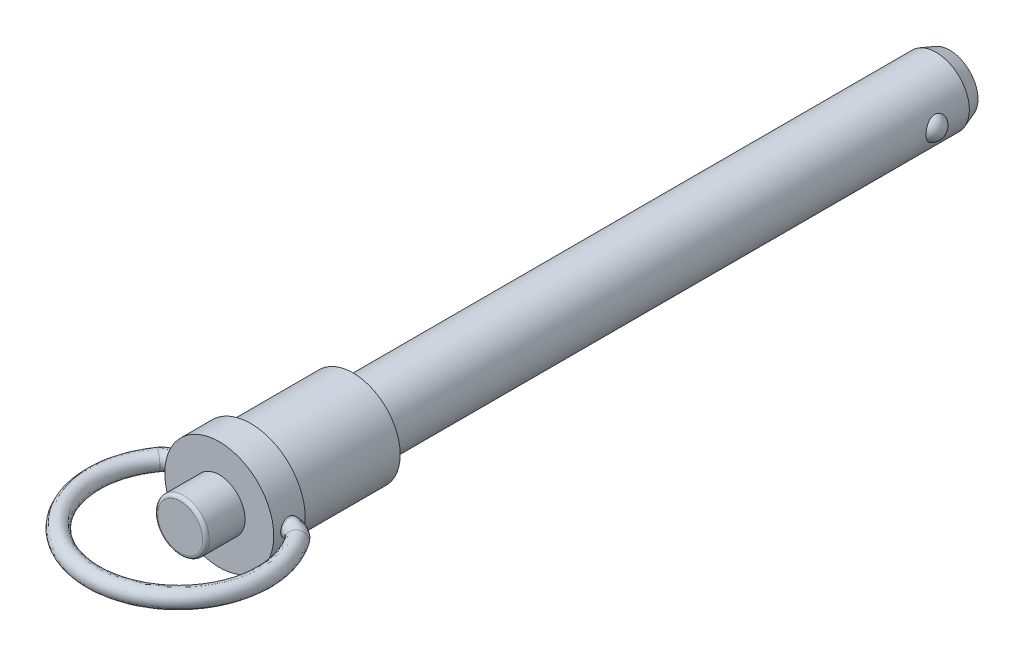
ISO-10303-21;
HEADER;
FILE_DESCRIPTION(('STEP AP214'),'2;1');
FILE_NAME('part.step','',(''),(''),'','','');
FILE_SCHEMA(('AUTOMOTIVE_DESIGN { 1 0 10303 214 1 1 1 1 }'));
ENDSEC;
DATA;
#1=APPLICATION_CONTEXT('core data for automotive mechanical design processes');
#2=APPLICATION_PROTOCOL_DEFINITION('international standard','automotive_design',2000,#1);
#3=PRODUCT_CONTEXT('',#1,'mechanical');
#4=PRODUCT('Part','Part','',(#3));
#5=PRODUCT_RELATED_PRODUCT_CATEGORY('part','',(#4));
#6=PRODUCT_DEFINITION_FORMATION('','',#4);
#7=PRODUCT_DEFINITION_CONTEXT('part definition',#1,'design');
#8=PRODUCT_DEFINITION('design','',#6,#7);
#9=PRODUCT_DEFINITION_SHAPE('','',#8);
#10=(LENGTH_UNIT() NAMED_UNIT(*) SI_UNIT(.MILLI.,.METRE.));
#11=(NAMED_UNIT(*) PLANE_ANGLE_UNIT() SI_UNIT($,.RADIAN.));
#12=(NAMED_UNIT(*) SI_UNIT($,.STERADIAN.) SOLID_ANGLE_UNIT());
#13=UNCERTAINTY_MEASURE_WITH_UNIT(LENGTH_MEASURE(1.E-05),#10,'distance_accuracy_value','');
#14=(GEOMETRIC_REPRESENTATION_CONTEXT(3) GLOBAL_UNCERTAINTY_ASSIGNED_CONTEXT((#13)) GLOBAL_UNIT_ASSIGNED_CONTEXT((#10,
#11,#12)) REPRESENTATION_CONTEXT('',''));
#15=CARTESIAN_POINT('',(0.,0.,0.));
#16=DIRECTION('',(0.,0.,1.));
#17=DIRECTION('',(1.,0.,0.));
#18=AXIS2_PLACEMENT_3D('',#15,#16,#17);
#19=CARTESIAN_POINT('',(4.22992248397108,0.,-89.0106));
#20=DIRECTION('',(0.,0.,1.));
#21=DIRECTION('',(0.,-1.,0.));
#22=AXIS2_PLACEMENT_3D('',#19,#20,#21);
#23=PLANE('',#22);
#24=CARTESIAN_POINT('',(0.,0.,-89.0105999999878));
#25=DIRECTION('',(0.,0.,1.));
#26=DIRECTION('',(0.,-1.,0.));
#27=AXIS2_PLACEMENT_3D('',#24,#25,#26);
#28=CIRCLE('',#27,4.22992248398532);
#29=CARTESIAN_POINT('',(0.,-4.22992248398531,-89.0105999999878));
#30=VERTEX_POINT('',#29);
#31=EDGE_CURVE('E146',#30,#30,#28,.T.);
#32=ORIENTED_EDGE('',*,*,#31,.F.);
#33=EDGE_LOOP('',(#32));
#34=FACE_BOUND('',#33,.T.);
#35=ADVANCED_FACE('F12',(#34),#23,.F.);
#36=CARTESIAN_POINT('',(4.14528,0.,-82.1018));
#37=DIRECTION('',(0.,0.,1.));
#38=DIRECTION('',(1.,0.,0.));
#39=AXIS2_PLACEMENT_3D('',#36,#37,#38);
#40=SPHERICAL_SURFACE('',#39,1.78562);
#41=CARTESIAN_POINT('',(4.96951,0.,-80.5177912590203));
#42=CARTESIAN_POINT('',(4.96950607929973,0.0989420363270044,-80.5177939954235));
#43=CARTESIAN_POINT('',(4.96652601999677,0.197972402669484,-80.5255413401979));
#44=CARTESIAN_POINT('',(4.9548871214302,0.393364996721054,-80.5564575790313));
#45=CARTESIAN_POINT('',(4.94621961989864,0.489722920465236,-80.5796499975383));
#46=CARTESIAN_POINT('',(4.92409154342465,0.676928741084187,-80.6411551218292));
#47=CARTESIAN_POINT('',(4.91063084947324,0.76777650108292,-80.6794682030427));
#48=CARTESIAN_POINT('',(4.88035492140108,0.941233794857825,-80.7706319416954));
#49=CARTESIAN_POINT('',(4.86354066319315,1.02384571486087,-80.8234783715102));
#50=CARTESIAN_POINT('',(4.82872838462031,1.1770723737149,-80.9418991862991));
#51=CARTESIAN_POINT('',(4.81075207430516,1.24784944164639,-81.0072693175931));
#52=CARTESIAN_POINT('',(4.77554803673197,1.37645403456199,-81.1499084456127));
#53=CARTESIAN_POINT('',(4.75832009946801,1.43428521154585,-81.2271740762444));
#54=CARTESIAN_POINT('',(4.72780678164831,1.53177669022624,-81.3868084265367));
#55=CARTESIAN_POINT('',(4.71434983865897,1.57230137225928,-81.4686150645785));
#56=CARTESIAN_POINT('',(4.69186742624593,1.63818072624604,-81.6386872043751));
#57=CARTESIAN_POINT('',(4.68283895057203,1.66354569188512,-81.7269482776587));
#58=CARTESIAN_POINT('',(4.6709836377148,1.69653228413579,-81.8994503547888));
#59=CARTESIAN_POINT('',(4.66770209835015,1.70545809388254,-81.9834120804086));
#60=CARTESIAN_POINT('',(4.66631401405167,1.70925445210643,-82.1516845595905));
#61=CARTESIAN_POINT('',(4.6682059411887,1.704129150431,-82.2359952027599));
#62=CARTESIAN_POINT('',(4.67672634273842,1.68059540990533,-82.3985435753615));
#63=CARTESIAN_POINT('',(4.68313557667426,1.662801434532,-82.4768831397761));
#64=CARTESIAN_POINT('',(4.69974058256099,1.6152701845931,-82.6294056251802));
#65=CARTESIAN_POINT('',(4.70993669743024,1.58553182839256,-82.7035881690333));
#66=CARTESIAN_POINT('',(4.73339939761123,1.51406854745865,-82.8481011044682));
#67=CARTESIAN_POINT('',(4.74674458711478,1.47202873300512,-82.9182634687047));
#68=CARTESIAN_POINT('',(4.76791353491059,1.40129782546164,-83.0176828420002));
#69=CARTESIAN_POINT('',(4.77516406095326,1.37643370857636,-83.049860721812));
#70=CARTESIAN_POINT('',(4.78988709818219,1.32429117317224,-83.112185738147));
#71=CARTESIAN_POINT('',(4.79735977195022,1.29701095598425,-83.1423313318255));
#72=CARTESIAN_POINT('',(4.82096563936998,1.20759667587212,-83.2338189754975));
#73=CARTESIAN_POINT('',(4.83719300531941,1.14140257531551,-83.2912462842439));
#74=CARTESIAN_POINT('',(4.86827537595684,1.00055962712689,-83.3950513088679));
#75=CARTESIAN_POINT('',(4.88312976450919,0.92590701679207,-83.441424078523));
#76=CARTESIAN_POINT('',(4.90385674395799,0.806241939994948,-83.5036735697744));
#77=CARTESIAN_POINT('',(4.91070233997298,0.763519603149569,-83.5237258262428));
#78=CARTESIAN_POINT('',(4.92344025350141,0.676535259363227,-83.5603862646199));
#79=CARTESIAN_POINT('',(4.92933338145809,0.632274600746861,-83.5769973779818));
#80=CARTESIAN_POINT('',(4.94535278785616,0.497629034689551,-83.6215733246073));
#81=CARTESIAN_POINT('',(4.95384366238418,0.405242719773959,-83.6443519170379));
#82=CARTESIAN_POINT('',(4.96296311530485,0.260199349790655,-83.6686021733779));
#83=CARTESIAN_POINT('',(4.96541051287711,0.208410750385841,-83.6750499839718));
#84=CARTESIAN_POINT('',(4.96868499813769,0.104422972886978,-83.6836540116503));
#85=CARTESIAN_POINT('',(4.96951206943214,0.052223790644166,-83.6858101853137));
#86=CARTESIAN_POINT('',(4.96950607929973,-0.0989420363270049,-83.6858060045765));
#87=CARTESIAN_POINT('',(4.96652601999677,-0.197972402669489,-83.6780586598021));
#88=CARTESIAN_POINT('',(4.9548871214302,-0.393364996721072,-83.6471424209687));
#89=CARTESIAN_POINT('',(4.94621961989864,-0.489722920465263,-83.6239500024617));
#90=CARTESIAN_POINT('',(4.92409154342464,-0.676928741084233,-83.5624448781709));
#91=CARTESIAN_POINT('',(4.91063084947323,-0.767776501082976,-83.5241317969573));
#92=CARTESIAN_POINT('',(4.88035492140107,-0.941233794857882,-83.4329680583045));
#93=CARTESIAN_POINT('',(4.86354066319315,-1.02384571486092,-83.3801216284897));
#94=CARTESIAN_POINT('',(4.8287283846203,-1.17707237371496,-83.2617008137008));
#95=CARTESIAN_POINT('',(4.81075207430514,-1.24784944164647,-83.1963306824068));
#96=CARTESIAN_POINT('',(4.77554803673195,-1.37645403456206,-83.0536915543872));
#97=CARTESIAN_POINT('',(4.758320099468,-1.43428521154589,-82.9764259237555));
#98=CARTESIAN_POINT('',(4.7278067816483,-1.53177669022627,-82.8167915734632));
#99=CARTESIAN_POINT('',(4.71434983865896,-1.57230137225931,-82.7349849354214));
#100=CARTESIAN_POINT('',(4.69186742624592,-1.63818072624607,-82.5649127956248));
#101=CARTESIAN_POINT('',(4.68283895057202,-1.66354569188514,-82.4766517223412));
#102=CARTESIAN_POINT('',(4.6709836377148,-1.69653228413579,-82.3041496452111));
#103=CARTESIAN_POINT('',(4.66770209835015,-1.70545809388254,-82.2201879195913));
#104=CARTESIAN_POINT('',(4.66631401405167,-1.70925445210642,-82.0519154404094));
#105=CARTESIAN_POINT('',(4.6682059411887,-1.704129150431,-81.9676047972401));
#106=CARTESIAN_POINT('',(4.67672634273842,-1.68059540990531,-81.8050564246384));
#107=CARTESIAN_POINT('',(4.68313557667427,-1.66280143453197,-81.7267168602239));
#108=CARTESIAN_POINT('',(4.699740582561,-1.61527018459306,-81.5741943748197));
#109=CARTESIAN_POINT('',(4.70993669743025,-1.58553182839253,-81.5000118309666));
#110=CARTESIAN_POINT('',(4.73339939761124,-1.51406854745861,-81.3554988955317));
#111=CARTESIAN_POINT('',(4.7467445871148,-1.47202873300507,-81.2853365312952));
#112=CARTESIAN_POINT('',(4.7679135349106,-1.4012978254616,-81.1859171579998));
#113=CARTESIAN_POINT('',(4.77516406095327,-1.37643370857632,-81.153739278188));
#114=CARTESIAN_POINT('',(4.7898870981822,-1.32429117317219,-81.091414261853));
#115=CARTESIAN_POINT('',(4.79735977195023,-1.29701095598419,-81.0612686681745));
#116=CARTESIAN_POINT('',(4.82096563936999,-1.20759667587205,-80.9697810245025));
#117=CARTESIAN_POINT('',(4.83719300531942,-1.14140257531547,-80.912353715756));
#118=CARTESIAN_POINT('',(4.86827537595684,-1.00055962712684,-80.8085486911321));
#119=CARTESIAN_POINT('',(4.8831297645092,-0.925907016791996,-80.762175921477));
#120=CARTESIAN_POINT('',(4.903856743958,-0.806241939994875,-80.6999264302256));
#121=CARTESIAN_POINT('',(4.91070233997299,-0.763519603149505,-80.6798741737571));
#122=CARTESIAN_POINT('',(4.92344025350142,-0.676535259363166,-80.6432137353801));
#123=CARTESIAN_POINT('',(4.9293333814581,-0.632274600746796,-80.6266026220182));
#124=CARTESIAN_POINT('',(4.94535278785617,-0.497629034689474,-80.5820266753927));
#125=CARTESIAN_POINT('',(4.95384366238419,-0.405242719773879,-80.5592480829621));
#126=CARTESIAN_POINT('',(4.96296311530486,-0.260199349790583,-80.5349978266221));
#127=CARTESIAN_POINT('',(4.96541051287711,-0.208410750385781,-80.5285500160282));
#128=CARTESIAN_POINT('',(4.96868499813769,-0.104422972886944,-80.5199459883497));
#129=CARTESIAN_POINT('',(4.96951206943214,-0.0522237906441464,-80.5177898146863));
#130=CARTESIAN_POINT('',(4.96951,0.,-80.5177912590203));
#131=B_SPLINE_CURVE_WITH_KNOTS('',3,(#41,#42,#43,#44,#45,#46,#47,#48,#49,#50,#51,#52,#53,#54,
#55,#56,#57,#58,#59,#60,#61,#62,#63,#64,#65,#66,#67,#68,#69,#70,#71,#72,#73,#74,#75,#76,#77,#78,
#79,#80,#81,#82,#83,#84,#85,#86,#87,#88,#89,#90,#91,#92,#93,#94,#95,#96,#97,#98,#99,#100,#101,
#102,#103,#104,#105,#106,#107,#108,#109,#110,#111,#112,#113,#114,#115,#116,#117,#118,#119,#120,
#121,#122,#123,#124,#125,#126,#127,#128,#129,#130),.UNSPECIFIED.,.T.,.F.,(4,2,2,2,2,2,2,2,2,2,2,
2,2,2,2,2,2,2,2,2,2,2,2,2,2,2,2,2,2,2,2,2,2,2,2,2,2,2,2,2,2,2,2,2,4),(0.,0.296633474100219,
0.59371978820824,0.890813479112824,1.1878208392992,1.4803431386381,1.77278281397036,
2.048132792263,2.32329559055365,2.57549318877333,2.82761631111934,3.06827754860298,
3.30896058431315,3.55644296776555,3.68025851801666,3.80416703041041,4.07032015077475,
4.33659213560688,4.47951069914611,4.62230700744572,4.90743385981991,5.0640019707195,
5.22057166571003,5.51720513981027,5.8142914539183,6.11138514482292,6.40839250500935,
6.70091480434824,6.9933544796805,7.26870445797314,7.54386725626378,7.79606485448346,
8.04818797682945,8.2888492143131,8.52953225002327,8.77701463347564,8.90083018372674,
9.02473869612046,9.29089181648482,9.55716380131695,9.7000823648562,9.8428786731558,
10.12800552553,10.2845736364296,10.44114333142),.UNSPECIFIED.);
#132=CARTESIAN_POINT('',(4.96951,0.,-80.5177912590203));
#133=VERTEX_POINT('',#132);
#134=EDGE_CURVE('E30',#133,#133,#131,.T.);
#135=ORIENTED_EDGE('',*,*,#134,.F.);
#136=EDGE_LOOP('',(#135));
#137=FACE_BOUND('',#136,.T.);
#138=ADVANCED_FACE('F131',(#137),#40,.T.);
#139=CARTESIAN_POINT('',(-4.14274,0.,-82.1018));
#140=DIRECTION('',(0.,0.,1.));
#141=DIRECTION('',(1.,0.,0.));
#142=AXIS2_PLACEMENT_3D('',#139,#140,#141);
#143=SPHERICAL_SURFACE('',#142,1.78562);
#144=CARTESIAN_POINT('',(-4.96951,0.,-83.6844844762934));
#145=CARTESIAN_POINT('',(-4.96950608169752,0.0989139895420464,-83.6844817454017));
#146=CARTESIAN_POINT('',(-4.96652771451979,0.197916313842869,-83.6767370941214));
#147=CARTESIAN_POINT('',(-4.95489537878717,0.393254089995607,-83.6458311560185));
#148=CARTESIAN_POINT('',(-4.94623274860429,0.489585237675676,-83.6226463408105));
#149=CARTESIAN_POINT('',(-4.92411699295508,0.676739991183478,-83.5611597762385));
#150=CARTESIAN_POINT('',(-4.91066371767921,0.767563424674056,-83.5228575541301));
#151=CARTESIAN_POINT('',(-4.88040469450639,0.940973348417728,-83.4317169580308));
#152=CARTESIAN_POINT('',(-4.86359992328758,1.02356222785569,-83.3788828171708));
#153=CARTESIAN_POINT('',(-4.82881079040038,1.17673191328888,-83.2604940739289));
#154=CARTESIAN_POINT('',(-4.81084830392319,1.2474765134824,-83.1951455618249));
#155=CARTESIAN_POINT('',(-4.77567379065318,1.37601594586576,-83.0525512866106));
#156=CARTESIAN_POINT('',(-4.75846155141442,1.43381446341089,-82.975308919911));
#157=CARTESIAN_POINT('',(-4.72798568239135,1.53122269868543,-82.8157481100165));
#158=CARTESIAN_POINT('',(-4.71454945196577,1.57170168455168,-82.7339947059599));
#159=CARTESIAN_POINT('',(-4.69210654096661,1.63749472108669,-82.5640357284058));
#160=CARTESIAN_POINT('',(-4.68309684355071,1.66281910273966,-82.4758345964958));
#161=CARTESIAN_POINT('',(-4.67127565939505,1.69572762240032,-82.3034786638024));
#162=CARTESIAN_POINT('',(-4.66800833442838,1.70461968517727,-82.2196034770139));
#163=CARTESIAN_POINT('',(-4.66664096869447,1.70836155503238,-82.0515092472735));
#164=CARTESIAN_POINT('',(-4.66853940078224,1.70321551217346,-81.967290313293));
#165=CARTESIAN_POINT('',(-4.67706392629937,1.67965578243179,-81.8049283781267));
#166=CARTESIAN_POINT('',(-4.68347088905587,1.6618566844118,-81.7266833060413));
#167=CARTESIAN_POINT('',(-4.7000634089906,1.61433052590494,-81.5743485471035));
#168=CARTESIAN_POINT('',(-4.7102493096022,1.58460238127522,-81.5002592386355));
#169=CARTESIAN_POINT('',(-4.73368609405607,1.51317152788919,-81.3559218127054));
#170=CARTESIAN_POINT('',(-4.74701574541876,1.47115297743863,-81.2858423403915));
#171=CARTESIAN_POINT('',(-4.76815825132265,1.40046463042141,-81.1865421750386));
#172=CARTESIAN_POINT('',(-4.77539944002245,1.37561647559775,-81.1544031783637));
#173=CARTESIAN_POINT('',(-4.79010305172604,1.32350942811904,-81.0921539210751));
#174=CARTESIAN_POINT('',(-4.7975656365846,1.29624874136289,-81.0620452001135));
#175=CARTESIAN_POINT('',(-4.82114242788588,1.20688876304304,-80.9706568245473));
#176=CARTESIAN_POINT('',(-4.83735008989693,1.14073361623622,-80.9132896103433));
#177=CARTESIAN_POINT('',(-4.8683937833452,0.999979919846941,-80.8095945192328));
#178=CARTESIAN_POINT('',(-4.88322919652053,0.925377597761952,-80.7632716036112));
#179=CARTESIAN_POINT('',(-4.90393144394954,0.805786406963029,-80.7010831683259));
#180=CARTESIAN_POINT('',(-4.91076989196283,0.763083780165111,-80.6810475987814));
#181=CARTESIAN_POINT('',(-4.92349428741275,0.676140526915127,-80.6444182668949));
#182=CARTESIAN_POINT('',(-4.92938104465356,0.631901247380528,-80.6278215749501));
#183=CARTESIAN_POINT('',(-4.94538285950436,0.497321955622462,-80.5832850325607));
#184=CARTESIAN_POINT('',(-4.95386398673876,0.404982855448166,-80.5605276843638));
#185=CARTESIAN_POINT('',(-4.96297201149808,0.260022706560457,-80.5363025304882));
#186=CARTESIAN_POINT('',(-4.96541608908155,0.208269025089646,-80.5298620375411));
#187=CARTESIAN_POINT('',(-4.96868612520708,0.10435176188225,-80.5212677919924));
#188=CARTESIAN_POINT('',(-4.96951206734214,0.0521881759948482,-80.5191140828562));
#189=CARTESIAN_POINT('',(-4.96950608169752,-0.0989139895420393,-80.5191182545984));
#190=CARTESIAN_POINT('',(-4.96652771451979,-0.197916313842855,-80.5268629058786));
#191=CARTESIAN_POINT('',(-4.95489537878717,-0.393254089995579,-80.5577688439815));
#192=CARTESIAN_POINT('',(-4.9462327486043,-0.489585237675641,-80.5809536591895));
#193=CARTESIAN_POINT('',(-4.92411699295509,-0.67673999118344,-80.6424402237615));
#194=CARTESIAN_POINT('',(-4.91066371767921,-0.767563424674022,-80.6807424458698));
#195=CARTESIAN_POINT('',(-4.8804046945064,-0.940973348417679,-80.7718830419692));
#196=CARTESIAN_POINT('',(-4.86359992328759,-1.02356222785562,-80.8247171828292));
#197=CARTESIAN_POINT('',(-4.82881079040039,-1.17673191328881,-80.9431059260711));
#198=CARTESIAN_POINT('',(-4.8108483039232,-1.24747651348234,-81.0084544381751));
#199=CARTESIAN_POINT('',(-4.77567379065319,-1.37601594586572,-81.1510487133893));
#200=CARTESIAN_POINT('',(-4.75846155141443,-1.43381446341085,-81.2282910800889));
#201=CARTESIAN_POINT('',(-4.72798568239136,-1.53122269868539,-81.3878518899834));
#202=CARTESIAN_POINT('',(-4.71454945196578,-1.57170168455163,-81.46960529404));
#203=CARTESIAN_POINT('',(-4.69210654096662,-1.63749472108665,-81.6395642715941));
#204=CARTESIAN_POINT('',(-4.68309684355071,-1.66281910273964,-81.7277654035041));
#205=CARTESIAN_POINT('',(-4.67127565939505,-1.69572762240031,-81.9001213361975));
#206=CARTESIAN_POINT('',(-4.66800833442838,-1.70461968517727,-81.983996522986));
#207=CARTESIAN_POINT('',(-4.66664096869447,-1.70836155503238,-82.1520907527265));
#208=CARTESIAN_POINT('',(-4.66853940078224,-1.70321551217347,-82.236309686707));
#209=CARTESIAN_POINT('',(-4.67706392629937,-1.6796557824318,-82.3986716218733));
#210=CARTESIAN_POINT('',(-4.68347088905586,-1.66185668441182,-82.4769166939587));
#211=CARTESIAN_POINT('',(-4.70006340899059,-1.61433052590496,-82.6292514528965));
#212=CARTESIAN_POINT('',(-4.7102493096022,-1.58460238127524,-82.7033407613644));
#213=CARTESIAN_POINT('',(-4.73368609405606,-1.51317152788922,-82.8476781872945));
#214=CARTESIAN_POINT('',(-4.74701574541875,-1.47115297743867,-82.9177576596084));
#215=CARTESIAN_POINT('',(-4.76815825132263,-1.40046463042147,-83.0170578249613));
#216=CARTESIAN_POINT('',(-4.77539944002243,-1.37561647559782,-83.0491968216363));
#217=CARTESIAN_POINT('',(-4.79010305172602,-1.3235094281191,-83.1114460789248));
#218=CARTESIAN_POINT('',(-4.79756563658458,-1.29624874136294,-83.1415547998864));
#219=CARTESIAN_POINT('',(-4.82114242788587,-1.20688876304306,-83.2329431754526));
#220=CARTESIAN_POINT('',(-4.83735008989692,-1.14073361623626,-83.2903103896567));
#221=CARTESIAN_POINT('',(-4.86839378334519,-0.999979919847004,-83.3940054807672));
#222=CARTESIAN_POINT('',(-4.88322919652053,-0.925377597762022,-83.4403283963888));
#223=CARTESIAN_POINT('',(-4.90393144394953,-0.805786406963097,-83.5025168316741));
#224=CARTESIAN_POINT('',(-4.91076989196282,-0.763083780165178,-83.5225524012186));
#225=CARTESIAN_POINT('',(-4.92349428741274,-0.676140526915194,-83.5591817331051));
#226=CARTESIAN_POINT('',(-4.92938104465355,-0.631901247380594,-83.5757784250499));
#227=CARTESIAN_POINT('',(-4.94538285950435,-0.49732195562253,-83.6203149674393));
#228=CARTESIAN_POINT('',(-4.95386398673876,-0.404982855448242,-83.6430723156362));
#229=CARTESIAN_POINT('',(-4.96297201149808,-0.260022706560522,-83.6672974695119));
#230=CARTESIAN_POINT('',(-4.96541608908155,-0.208269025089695,-83.6737379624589));
#231=CARTESIAN_POINT('',(-4.96868612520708,-0.104351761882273,-83.6823322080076));
#232=CARTESIAN_POINT('',(-4.96951206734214,-0.0521881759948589,-83.6844859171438));
#233=CARTESIAN_POINT('',(-4.96951,0.,-83.6844844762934));
#234=B_SPLINE_CURVE_WITH_KNOTS('',3,(#144,#145,#146,#147,#148,#149,#150,#151,#152,#153,#154,
#155,#156,#157,#158,#159,#160,#161,#162,#163,#164,#165,#166,#167,#168,#169,#170,#171,#172,#173,
#174,#175,#176,#177,#178,#179,#180,#181,#182,#183,#184,#185,#186,#187,#188,#189,#190,#191,#192,
#193,#194,#195,#196,#197,#198,#199,#200,#201,#202,#203,#204,#205,#206,#207,#208,#209,#210,#211,
#212,#213,#214,#215,#216,#217,#218,#219,#220,#221,#222,#223,#224,#225,#226,#227,#228,#229,#230,
#231,#232,#233),.UNSPECIFIED.,.T.,.F.,(4,2,2,2,2,2,2,2,2,2,2,2,2,2,2,2,2,2,2,2,2,2,2,2,2,2,2,2,
2,2,2,2,2,2,2,2,2,2,2,2,2,2,2,2,4),(0.,0.296549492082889,0.593551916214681,0.89056362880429,
1.18748891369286,1.47988990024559,1.77220754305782,2.04734712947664,2.32229893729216,
2.5742274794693,2.82608155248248,3.06647154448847,3.30688338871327,3.55411689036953,
3.67780799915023,3.80159187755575,4.06753268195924,4.3335927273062,4.47643431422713,
4.61915370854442,4.90412739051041,5.06058877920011,5.2170517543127,5.51360124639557,
5.81060367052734,6.10761538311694,6.40454066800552,6.69694165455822,6.98925929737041,
7.26439888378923,7.53935069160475,7.79127923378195,8.04313330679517,8.28352329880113,
8.52393514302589,8.77116864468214,8.89485975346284,9.01864363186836,9.28458443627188,
9.55064448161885,9.69348606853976,9.83620546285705,10.121179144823,10.2776405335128,
10.4341035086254),.UNSPECIFIED.);
#235=CARTESIAN_POINT('',(-4.96951,0.,-83.6844844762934));
#236=VERTEX_POINT('',#235);
#237=EDGE_CURVE('E8',#236,#236,#234,.T.);
#238=ORIENTED_EDGE('',*,*,#237,.F.);
#239=EDGE_LOOP('',(#238));
#240=FACE_BOUND('',#239,.T.);
#241=ADVANCED_FACE('F44',(#240),#143,.T.);
#242=CARTESIAN_POINT('',(0.,0.,-86.978600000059));
#243=DIRECTION('',(0.,0.,1.));
#244=DIRECTION('',(0.,-1.,0.));
#245=AXIS2_PLACEMENT_3D('',#242,#243,#244);
#246=CONICAL_SURFACE('',#245,4.96950999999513,0.349065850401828);
#247=ORIENTED_EDGE('',*,*,#31,.T.);
#248=EDGE_LOOP('',(#247));
#249=FACE_BOUND('',#248,.T.);
#250=CARTESIAN_POINT('',(0.,0.,-86.9786));
#251=DIRECTION('',(0.,0.,1.));
#252=DIRECTION('',(0.,-1.,0.));
#253=AXIS2_PLACEMENT_3D('',#250,#251,#252);
#254=CIRCLE('',#253,4.96951);
#255=CARTESIAN_POINT('',(0.,-4.96951,-86.9786));
#256=VERTEX_POINT('',#255);
#257=EDGE_CURVE('E25',#256,#256,#254,.T.);
#258=ORIENTED_EDGE('',*,*,#257,.F.);
#259=EDGE_LOOP('',(#258));
#260=FACE_BOUND('',#259,.T.);
#261=ADVANCED_FACE('F54',(#249,#260),#246,.T.);
#262=CARTESIAN_POINT('',(0.,0.,-55.));
#263=DIRECTION('',(0.,0.,1.));
#264=DIRECTION('',(-0.810321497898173,-0.585985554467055,0.));
#265=AXIS2_PLACEMENT_3D('',#262,#263,#264);
#266=CYLINDRICAL_SURFACE('',#265,4.96951);
#267=ORIENTED_EDGE('',*,*,#257,.T.);
#268=EDGE_LOOP('',(#267));
#269=FACE_BOUND('',#268,.T.);
#270=ORIENTED_EDGE('',*,*,#237,.T.);
#271=EDGE_LOOP('',(#270));
#272=FACE_BOUND('',#271,.T.);
#273=ORIENTED_EDGE('',*,*,#134,.T.);
#274=EDGE_LOOP('',(#273));
#275=FACE_BOUND('',#274,.T.);
#276=CARTESIAN_POINT('',(0.,0.,0.));
#277=DIRECTION('',(0.,0.,-1.));
#278=DIRECTION('',(0.,1.,0.));
#279=AXIS2_PLACEMENT_3D('',#276,#277,#278);
#280=CIRCLE('',#279,4.96951);
#281=CARTESIAN_POINT('',(0.,4.96951000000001,0.));
#282=VERTEX_POINT('',#281);
#283=EDGE_CURVE('E143',#282,#282,#280,.T.);
#284=ORIENTED_EDGE('',*,*,#283,.T.);
#285=EDGE_LOOP('',(#284));
#286=FACE_BOUND('',#285,.T.);
#287=ADVANCED_FACE('F49',(#269,#272,#275,#286),#266,.T.);
#288=CARTESIAN_POINT('',(0.,0.,25.765));
#289=DIRECTION('',(0.,0.,1.));
#290=DIRECTION('',(1.,0.,0.));
#291=AXIS2_PLACEMENT_3D('',#288,#289,#290);
#292=PLANE('',#291);
#293=CARTESIAN_POINT('',(0.,0.,25.765));
#294=DIRECTION('',(0.,0.,1.));
#295=DIRECTION('',(1.,0.,0.));
#296=AXIS2_PLACEMENT_3D('',#293,#294,#295);
#297=CIRCLE('',#296,3.3481);
#298=CARTESIAN_POINT('',(3.3481,0.,25.765));
#299=VERTEX_POINT('',#298);
#300=EDGE_CURVE('E163',#299,#299,#297,.T.);
#301=ORIENTED_EDGE('',*,*,#300,.T.);
#302=EDGE_LOOP('',(#301));
#303=FACE_BOUND('',#302,.T.);
#304=ADVANCED_FACE('F53',(#303),#292,.T.);
#305=CARTESIAN_POINT('',(0.,0.,25.265));
#306=DIRECTION('',(0.,0.,1.));
#307=DIRECTION('',(1.,0.,0.));
#308=AXIS2_PLACEMENT_3D('',#305,#306,#307);
#309=TOROIDAL_SURFACE('',#308,3.3481,0.5);
#310=CARTESIAN_POINT('',(0.,0.,25.265));
#311=DIRECTION('',(0.,0.,1.));
#312=DIRECTION('',(1.,0.,0.));
#313=AXIS2_PLACEMENT_3D('',#310,#311,#312);
#314=CIRCLE('',#313,3.8481);
#315=CARTESIAN_POINT('',(3.8481,0.,25.265));
#316=VERTEX_POINT('',#315);
#317=EDGE_CURVE('E168',#316,#316,#314,.T.);
#318=ORIENTED_EDGE('',*,*,#317,.T.);
#319=EDGE_LOOP('',(#318));
#320=FACE_BOUND('',#319,.T.);
#321=ORIENTED_EDGE('',*,*,#300,.F.);
#322=EDGE_LOOP('',(#321));
#323=FACE_BOUND('',#322,.T.);
#324=ADVANCED_FACE('F76',(#320,#323),#309,.T.);
#325=CARTESIAN_POINT('',(11.4497733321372,0.,17.9437724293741));
#326=CARTESIAN_POINT('',(11.8265676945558,0.,18.4801460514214));
#327=CARTESIAN_POINT('',(12.6551080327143,0.,19.8662433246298));
#328=CARTESIAN_POINT('',(13.4882796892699,0.,22.0133244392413));
#329=CARTESIAN_POINT('',(14.0014195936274,0.,24.4938075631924));
#330=CARTESIAN_POINT('',(14.0399868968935,0.,27.1482100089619));
#331=CARTESIAN_POINT('',(13.5501253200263,0.,29.8733661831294));
#332=CARTESIAN_POINT('',(12.5103672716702,0.,32.4943169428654));
#333=CARTESIAN_POINT('',(10.9649059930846,0.,34.8529407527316));
#334=CARTESIAN_POINT('',(9.01915526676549,0.,36.8217510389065));
#335=CARTESIAN_POINT('',(6.82219687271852,0.,38.3176313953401));
#336=CARTESIAN_POINT('',(4.51156788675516,0.,39.3254677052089));
#337=CARTESIAN_POINT('',(2.23137128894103,0.,39.879227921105));
#338=CARTESIAN_POINT('',(7.28333001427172E-13,0.,40.0580345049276));
#339=CARTESIAN_POINT('',(-2.23137128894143,0.,39.879227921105));
#340=CARTESIAN_POINT('',(-4.51156788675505,0.,39.3254677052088));
#341=CARTESIAN_POINT('',(-6.82219687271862,0.,38.31763139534));
#342=CARTESIAN_POINT('',(-9.01915526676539,0.,36.8217510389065));
#343=CARTESIAN_POINT('',(-10.9649059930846,0.,34.8529407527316));
#344=CARTESIAN_POINT('',(-12.5103672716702,0.,32.4943169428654));
#345=CARTESIAN_POINT('',(-13.5501253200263,0.,29.8733661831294));
#346=CARTESIAN_POINT('',(-14.0399868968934,0.,27.148210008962));
#347=CARTESIAN_POINT('',(-14.0014195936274,0.,24.4938075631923));
#348=CARTESIAN_POINT('',(-13.4882796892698,0.,22.0133244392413));
#349=CARTESIAN_POINT('',(-12.6551080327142,0.,19.8662433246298));
#350=CARTESIAN_POINT('',(-11.8265676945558,0.,18.4801460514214));
#351=CARTESIAN_POINT('',(-11.4497733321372,0.,17.9437724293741));
#352=CARTESIAN_POINT('',(11.4497733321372,-2.59999999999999,17.9437724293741));
#353=CARTESIAN_POINT('',(11.7096770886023,-2.59999999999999,18.3137501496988));
#354=CARTESIAN_POINT('',(12.7137877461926,-2.59999999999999,19.9497749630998));
#355=CARTESIAN_POINT('',(13.4708176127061,-2.59999999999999,21.9884668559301));
#356=CARTESIAN_POINT('',(14.0065482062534,-2.6,24.5011082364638));
#357=CARTESIAN_POINT('',(14.0385176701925,-2.59999999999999,27.1461185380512));
#358=CARTESIAN_POINT('',(13.5505344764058,-2.59999999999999,29.8739486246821));
#359=CARTESIAN_POINT('',(12.5102566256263,-2.59999999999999,32.4941594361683));
#360=CARTESIAN_POINT('',(10.9649350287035,-2.59999999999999,34.8529820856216));
#361=CARTESIAN_POINT('',(9.01914786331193,-2.6,36.8217404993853));
#362=CARTESIAN_POINT('',(6.82219870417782,-2.59999999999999,38.3176340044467));
#363=CARTESIAN_POINT('',(4.51156744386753,-2.59999999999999,39.3254670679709));
#364=CARTESIAN_POINT('',(2.23137138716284,-2.59999999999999,39.879228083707));
#365=CARTESIAN_POINT('',(7.28268272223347E-13,-2.59999999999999,40.0580344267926));
#366=CARTESIAN_POINT('',(-2.23137138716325,-2.6,39.879228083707));
#367=CARTESIAN_POINT('',(-4.51156744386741,-2.59999999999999,39.3254670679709));
#368=CARTESIAN_POINT('',(-6.82219870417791,-2.6,38.3176340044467));
#369=CARTESIAN_POINT('',(-9.01914786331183,-2.59999999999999,36.8217404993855));
#370=CARTESIAN_POINT('',(-10.9649350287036,-2.59999999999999,34.8529820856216));
#371=CARTESIAN_POINT('',(-12.5102566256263,-2.59999999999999,32.4941594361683));
#372=CARTESIAN_POINT('',(-13.5505344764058,-2.59999999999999,29.8739486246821));
#373=CARTESIAN_POINT('',(-14.0385176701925,-2.6,27.1461185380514));
#374=CARTESIAN_POINT('',(-14.0065482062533,-2.59999999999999,24.5011082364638));
#375=CARTESIAN_POINT('',(-13.4708176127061,-2.59999999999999,21.9884668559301));
#376=CARTESIAN_POINT('',(-12.7137877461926,-2.59999999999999,19.9497749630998));
#377=CARTESIAN_POINT('',(-11.7096770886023,-2.59999999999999,18.3137501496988));
#378=CARTESIAN_POINT('',(-11.4497733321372,-2.59999999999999,17.9437724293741));
#379=CARTESIAN_POINT('',(9.33442519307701,-2.59999999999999,19.4556422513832));
#380=CARTESIAN_POINT('',(9.59432894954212,-2.59999999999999,19.8256199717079));
#381=CARTESIAN_POINT('',(10.3328710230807,-2.59999999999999,21.0505437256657));
#382=CARTESIAN_POINT('',(10.9823054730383,-2.59999999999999,22.7644201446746));
#383=CARTESIAN_POINT('',(11.4042672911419,-2.6,24.7888114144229));
#384=CARTESIAN_POINT('',(11.4306312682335,-2.59999999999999,26.9493701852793));
#385=CARTESIAN_POINT('',(11.0308912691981,-2.59999999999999,29.1626260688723));
#386=CARTESIAN_POINT('',(10.1828123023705,-2.59999999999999,31.2968985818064));
#387=CARTESIAN_POINT('',(8.92160036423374,-2.59999999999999,33.2166725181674));
#388=CARTESIAN_POINT('',(7.34098330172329,-2.6,34.8144779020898));
#389=CARTESIAN_POINT('',(5.5491258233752,-2.59999999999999,36.0332448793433));
#390=CARTESIAN_POINT('',(3.67550207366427,-2.59999999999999,36.8497543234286));
#391=CARTESIAN_POINT('',(1.8109997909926,-2.59999999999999,37.3021941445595));
#392=CARTESIAN_POINT('',(-9.61358135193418E-13,-2.59999999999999,37.4469985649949));
#393=CARTESIAN_POINT('',(-1.81099979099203,-2.6,37.3021941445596));
#394=CARTESIAN_POINT('',(-3.6755020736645,-2.59999999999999,36.8497543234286));
#395=CARTESIAN_POINT('',(-5.54912582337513,-2.6,36.0332448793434));
#396=CARTESIAN_POINT('',(-7.34098330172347,-2.59999999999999,34.8144779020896));
#397=CARTESIAN_POINT('',(-8.92160036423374,-2.59999999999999,33.2166725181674));
#398=CARTESIAN_POINT('',(-10.1828123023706,-2.59999999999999,31.2968985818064));
#399=CARTESIAN_POINT('',(-11.0308912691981,-2.59999999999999,29.1626260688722));
#400=CARTESIAN_POINT('',(-11.4306312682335,-2.6,26.9493701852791));
#401=CARTESIAN_POINT('',(-11.4042672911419,-2.59999999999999,24.7888114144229));
#402=CARTESIAN_POINT('',(-10.9823054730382,-2.59999999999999,22.7644201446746));
#403=CARTESIAN_POINT('',(-10.3328710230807,-2.59999999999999,21.0505437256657));
#404=CARTESIAN_POINT('',(-9.59432894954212,-2.59999999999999,19.8256199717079));
#405=CARTESIAN_POINT('',(-9.33442519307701,-2.59999999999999,19.4556422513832));
#406=CARTESIAN_POINT('',(9.33442519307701,0.,19.4556422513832));
#407=CARTESIAN_POINT('',(9.65277425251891,0.,19.9088179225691));
#408=CARTESIAN_POINT('',(10.3035311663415,0.,21.0087779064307));
#409=CARTESIAN_POINT('',(10.9910365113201,0.,22.7768489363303));
#410=CARTESIAN_POINT('',(11.4017029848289,0.,24.7851610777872));
#411=CARTESIAN_POINT('',(11.431365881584,0.,26.9504159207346));
#412=CARTESIAN_POINT('',(11.0306866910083,0.,29.1623348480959));
#413=CARTESIAN_POINT('',(10.1828676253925,0.,31.2969773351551));
#414=CARTESIAN_POINT('',(8.92158584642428,0.,33.2166518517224));
#415=CARTESIAN_POINT('',(7.34098700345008,0.,34.8144831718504));
#416=CARTESIAN_POINT('',(5.54912490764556,0.,36.03324357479));
#417=CARTESIAN_POINT('',(3.67550229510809,0.,36.8497546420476));
#418=CARTESIAN_POINT('',(1.8109997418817,0.,37.3021940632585));
#419=CARTESIAN_POINT('',(-9.6127182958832E-13,0.,37.4469986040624));
#420=CARTESIAN_POINT('',(-1.81099974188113,0.,37.3021940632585));
#421=CARTESIAN_POINT('',(-3.67550229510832,0.,36.8497546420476));
#422=CARTESIAN_POINT('',(-5.54912490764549,0.,36.03324357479));
#423=CARTESIAN_POINT('',(-7.34098700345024,0.,34.8144831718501));
#424=CARTESIAN_POINT('',(-8.92158584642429,0.,33.2166518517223));
#425=CARTESIAN_POINT('',(-10.1828676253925,0.,31.296977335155));
#426=CARTESIAN_POINT('',(-11.0306866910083,0.,29.1623348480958));
#427=CARTESIAN_POINT('',(-11.431365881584,0.,26.9504159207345));
#428=CARTESIAN_POINT('',(-11.4017029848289,0.,24.7851610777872));
#429=CARTESIAN_POINT('',(-10.9910365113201,0.,22.7768489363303));
#430=CARTESIAN_POINT('',(-10.3035311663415,0.,21.0087779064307));
#431=CARTESIAN_POINT('',(-9.6527742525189,0.,19.9088179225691));
#432=CARTESIAN_POINT('',(-9.33442519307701,0.,19.4556422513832));
#433=CARTESIAN_POINT('',(9.33442519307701,2.59999999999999,19.4556422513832));
#434=CARTESIAN_POINT('',(9.7112195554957,2.59999999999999,19.9920158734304));
#435=CARTESIAN_POINT('',(10.2741913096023,2.59999999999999,20.9670120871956));
#436=CARTESIAN_POINT('',(10.999767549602,2.59999999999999,22.7892777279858));
#437=CARTESIAN_POINT('',(11.3991386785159,2.6,24.7815107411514));
#438=CARTESIAN_POINT('',(11.4321004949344,2.59999999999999,26.9514616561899));
#439=CARTESIAN_POINT('',(11.0304821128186,2.59999999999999,29.1620436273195));
#440=CARTESIAN_POINT('',(10.1829229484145,2.59999999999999,31.2970560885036));
#441=CARTESIAN_POINT('',(8.92157132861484,2.59999999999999,33.2166311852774));
#442=CARTESIAN_POINT('',(7.34099070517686,2.6,34.8144884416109));
#443=CARTESIAN_POINT('',(5.54912399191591,2.59999999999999,36.0332422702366));
#444=CARTESIAN_POINT('',(3.67550251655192,2.59999999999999,36.8497549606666));
#445=CARTESIAN_POINT('',(1.81099969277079,2.59999999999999,37.3021939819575));
#446=CARTESIAN_POINT('',(-9.61422864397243E-13,2.59999999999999,37.4469986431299));
#447=CARTESIAN_POINT('',(-1.81099969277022,2.6,37.3021939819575));
#448=CARTESIAN_POINT('',(-3.67550251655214,2.59999999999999,36.8497549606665));
#449=CARTESIAN_POINT('',(-5.54912399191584,2.6,36.0332422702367));
#450=CARTESIAN_POINT('',(-7.34099070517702,2.59999999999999,34.8144884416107));
#451=CARTESIAN_POINT('',(-8.92157132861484,2.59999999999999,33.2166311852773));
#452=CARTESIAN_POINT('',(-10.1829229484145,2.59999999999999,31.2970560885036));
#453=CARTESIAN_POINT('',(-11.0304821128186,2.59999999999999,29.1620436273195));
#454=CARTESIAN_POINT('',(-11.4321004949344,2.6,26.9514616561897));
#455=CARTESIAN_POINT('',(-11.3991386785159,2.59999999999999,24.7815107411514));
#456=CARTESIAN_POINT('',(-10.999767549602,2.59999999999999,22.7892777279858));
#457=CARTESIAN_POINT('',(-10.2741913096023,2.59999999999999,20.9670120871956));
#458=CARTESIAN_POINT('',(-9.71121955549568,2.59999999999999,19.9920158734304));
#459=CARTESIAN_POINT('',(-9.33442519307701,2.59999999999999,19.4556422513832));
#460=CARTESIAN_POINT('',(11.4497733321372,2.59999999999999,17.9437724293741));
#461=CARTESIAN_POINT('',(11.9434583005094,2.59999999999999,18.6465419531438));
#462=CARTESIAN_POINT('',(12.5964283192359,2.59999999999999,19.7827116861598));
#463=CARTESIAN_POINT('',(13.5057417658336,2.59999999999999,22.0381820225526));
#464=CARTESIAN_POINT('',(13.9962909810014,2.6,24.4865068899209));
#465=CARTESIAN_POINT('',(14.0414561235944,2.59999999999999,27.1503014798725));
#466=CARTESIAN_POINT('',(13.5497161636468,2.59999999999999,29.8727837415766));
#467=CARTESIAN_POINT('',(12.5104779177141,2.59999999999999,32.4944744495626));
#468=CARTESIAN_POINT('',(10.9648769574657,2.59999999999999,34.8528994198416));
#469=CARTESIAN_POINT('',(9.01916267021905,2.6,36.8217615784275));
#470=CARTESIAN_POINT('',(6.82219504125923,2.59999999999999,38.3176287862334));
#471=CARTESIAN_POINT('',(4.5115683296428,2.59999999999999,39.3254683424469));
#472=CARTESIAN_POINT('',(2.23137119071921,2.59999999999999,39.8792277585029));
#473=CARTESIAN_POINT('',(7.28203543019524E-13,2.59999999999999,40.0580345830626));
#474=CARTESIAN_POINT('',(-2.23137119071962,2.6,39.879227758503));
#475=CARTESIAN_POINT('',(-4.51156832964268,2.59999999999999,39.3254683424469));
#476=CARTESIAN_POINT('',(-6.82219504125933,2.6,38.3176287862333));
#477=CARTESIAN_POINT('',(-9.01916267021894,2.59999999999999,36.8217615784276));
#478=CARTESIAN_POINT('',(-10.9648769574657,2.59999999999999,34.8528994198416));
#479=CARTESIAN_POINT('',(-12.5104779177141,2.59999999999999,32.4944744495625));
#480=CARTESIAN_POINT('',(-13.5497161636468,2.59999999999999,29.8727837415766));
#481=CARTESIAN_POINT('',(-14.0414561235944,2.6,27.1503014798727));
#482=CARTESIAN_POINT('',(-13.9962909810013,2.59999999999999,24.4865068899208));
#483=CARTESIAN_POINT('',(-13.5057417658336,2.59999999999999,22.0381820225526));
#484=CARTESIAN_POINT('',(-12.5964283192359,2.59999999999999,19.7827116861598));
#485=CARTESIAN_POINT('',(-11.9434583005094,2.59999999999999,18.6465419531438));
#486=CARTESIAN_POINT('',(-11.4497733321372,2.59999999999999,17.9437724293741));
#487=CARTESIAN_POINT('',(11.4497733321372,0.,17.9437724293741));
#488=CARTESIAN_POINT('',(11.8265676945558,0.,18.4801460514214));
#489=CARTESIAN_POINT('',(12.6551080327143,0.,19.8662433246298));
#490=CARTESIAN_POINT('',(13.4882796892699,0.,22.0133244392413));
#491=CARTESIAN_POINT('',(14.0014195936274,0.,24.4938075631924));
#492=CARTESIAN_POINT('',(14.0399868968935,0.,27.1482100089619));
#493=CARTESIAN_POINT('',(13.5501253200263,0.,29.8733661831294));
#494=CARTESIAN_POINT('',(12.5103672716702,0.,32.4943169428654));
#495=CARTESIAN_POINT('',(10.9649059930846,0.,34.8529407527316));
#496=CARTESIAN_POINT('',(9.01915526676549,0.,36.8217510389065));
#497=CARTESIAN_POINT('',(6.82219687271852,0.,38.3176313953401));
#498=CARTESIAN_POINT('',(4.51156788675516,0.,39.3254677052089));
#499=CARTESIAN_POINT('',(2.23137128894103,0.,39.879227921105));
#500=CARTESIAN_POINT('',(7.28333001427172E-13,0.,40.0580345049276));
#501=CARTESIAN_POINT('',(-2.23137128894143,0.,39.879227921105));
#502=CARTESIAN_POINT('',(-4.51156788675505,0.,39.3254677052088));
#503=CARTESIAN_POINT('',(-6.82219687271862,0.,38.31763139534));
#504=CARTESIAN_POINT('',(-9.01915526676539,0.,36.8217510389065));
#505=CARTESIAN_POINT('',(-10.9649059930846,0.,34.8529407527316));
#506=CARTESIAN_POINT('',(-12.5103672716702,0.,32.4943169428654));
#507=CARTESIAN_POINT('',(-13.5501253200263,0.,29.8733661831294));
#508=CARTESIAN_POINT('',(-14.0399868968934,0.,27.148210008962));
#509=CARTESIAN_POINT('',(-14.0014195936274,0.,24.4938075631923));
#510=CARTESIAN_POINT('',(-13.4882796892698,0.,22.0133244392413));
#511=CARTESIAN_POINT('',(-12.6551080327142,0.,19.8662433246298));
#512=CARTESIAN_POINT('',(-11.8265676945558,0.,18.4801460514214));
#513=CARTESIAN_POINT('',(-11.4497733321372,0.,17.9437724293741));
#514=(BOUNDED_SURFACE() B_SPLINE_SURFACE(3,3,((#325,#326,#327,#328,#329,#330,#331,#332,#333,
#334,#335,#336,#337,#338,#339,#340,#341,#342,#343,#344,#345,#346,#347,#348,#349,#350,#351),
(#352,#353,#354,#355,#356,#357,#358,#359,#360,#361,#362,#363,#364,#365,#366,#367,#368,#369,#370,
#371,#372,#373,#374,#375,#376,#377,#378),(#379,#380,#381,#382,#383,#384,#385,#386,#387,#388,
#389,#390,#391,#392,#393,#394,#395,#396,#397,#398,#399,#400,#401,#402,#403,#404,#405),(#406,
#407,#408,#409,#410,#411,#412,#413,#414,#415,#416,#417,#418,#419,#420,#421,#422,#423,#424,#425,
#426,#427,#428,#429,#430,#431,#432),(#433,#434,#435,#436,#437,#438,#439,#440,#441,#442,#443,
#444,#445,#446,#447,#448,#449,#450,#451,#452,#453,#454,#455,#456,#457,#458,#459),(#460,#461,
#462,#463,#464,#465,#466,#467,#468,#469,#470,#471,#472,#473,#474,#475,#476,#477,#478,#479,#480,
#481,#482,#483,#484,#485,#486),(#487,#488,#489,#490,#491,#492,#493,#494,#495,#496,#497,#498,
#499,#500,#501,#502,#503,#504,#505,#506,#507,#508,#509,#510,#511,#512,#513)),.UNSPECIFIED.,.T.,
.F.,.F.) B_SPLINE_SURFACE_WITH_KNOTS((4,3,4),(4,1,1,1,1,1,1,1,1,1,1,1,1,1,1,1,1,1,1,1,1,1,1,1,
4),(0.,0.5,1.),(0.,0.0355177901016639,0.0739139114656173,0.114982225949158,0.158533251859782,
0.203808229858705,0.250000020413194,0.296191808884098,0.34146678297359,0.385017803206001,
0.426086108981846,0.464482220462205,0.5,0.535517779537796,0.573913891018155,0.614982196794,
0.658533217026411,0.703808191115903,0.749999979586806,0.796191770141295,0.841466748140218,
0.885017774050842,0.926086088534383,0.964482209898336,1.),
.UNSPECIFIED.) GEOMETRIC_REPRESENTATION_ITEM() RATIONAL_B_SPLINE_SURFACE(((1.,1.,1.,1.,1.,1.,1.,
1.,1.,1.,1.,1.,1.,1.,1.,1.,1.,1.,1.,1.,1.,1.,1.,1.,1.,1.,1.),(0.333333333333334,
0.333333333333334,0.333333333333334,0.333333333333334,0.333333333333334,0.333333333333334,
0.333333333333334,0.333333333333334,0.333333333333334,0.333333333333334,0.333333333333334,
0.333333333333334,0.333333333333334,0.333333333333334,0.333333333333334,0.333333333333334,
0.333333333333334,0.333333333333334,0.333333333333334,0.333333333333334,0.333333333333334,
0.333333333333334,0.333333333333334,0.333333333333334,0.333333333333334,0.333333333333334,
0.333333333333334),(0.333333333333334,0.333333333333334,0.333333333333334,0.333333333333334,
0.333333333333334,0.333333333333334,0.333333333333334,0.333333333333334,0.333333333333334,
0.333333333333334,0.333333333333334,0.333333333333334,0.333333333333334,0.333333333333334,
0.333333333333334,0.333333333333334,0.333333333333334,0.333333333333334,0.333333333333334,
0.333333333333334,0.333333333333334,0.333333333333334,0.333333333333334,0.333333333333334,
0.333333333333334,0.333333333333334,0.333333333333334),(1.,1.,1.,1.,1.,1.,1.,1.,1.,1.,1.,1.,1.,
1.,1.,1.,1.,1.,1.,1.,1.,1.,1.,1.,1.,1.,1.),(0.333333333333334,0.333333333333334,
0.333333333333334,0.333333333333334,0.333333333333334,0.333333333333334,0.333333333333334,
0.333333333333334,0.333333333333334,0.333333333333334,0.333333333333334,0.333333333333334,
0.333333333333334,0.333333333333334,0.333333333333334,0.333333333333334,0.333333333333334,
0.333333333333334,0.333333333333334,0.333333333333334,0.333333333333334,0.333333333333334,
0.333333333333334,0.333333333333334,0.333333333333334,0.333333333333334,0.333333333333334),
(0.333333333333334,0.333333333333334,0.333333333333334,0.333333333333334,0.333333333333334,
0.333333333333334,0.333333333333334,0.333333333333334,0.333333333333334,0.333333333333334,
0.333333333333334,0.333333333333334,0.333333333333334,0.333333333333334,0.333333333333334,
0.333333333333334,0.333333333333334,0.333333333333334,0.333333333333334,0.333333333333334,
0.333333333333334,0.333333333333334,0.333333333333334,0.333333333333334,0.333333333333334,
0.333333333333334,0.333333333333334),(1.,1.,1.,1.,1.,1.,1.,1.,1.,1.,1.,1.,1.,1.,1.,1.,1.,1.,1.,
1.,1.,1.,1.,1.,1.,1.,1.))) REPRESENTATION_ITEM('') SURFACE());
#515=CARTESIAN_POINT('',(11.4497733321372,0.,17.9437724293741));
#516=CARTESIAN_POINT('',(11.4497733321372,-2.59999999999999,17.9437724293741));
#517=CARTESIAN_POINT('',(9.33442519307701,-2.59999999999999,19.4556422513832));
#518=CARTESIAN_POINT('',(9.33442519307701,0.,19.4556422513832));
#519=CARTESIAN_POINT('',(9.33442519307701,2.59999999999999,19.4556422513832));
#520=CARTESIAN_POINT('',(11.4497733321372,2.59999999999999,17.9437724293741));
#521=CARTESIAN_POINT('',(11.4497733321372,0.,17.9437724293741));
#522=(BOUNDED_CURVE() B_SPLINE_CURVE(3,(#515,#516,#517,#518,#519,#520,#521),.UNSPECIFIED.,.T.,
.F.) B_SPLINE_CURVE_WITH_KNOTS((4,3,4),(0.,0.5,1.),
.UNSPECIFIED.) CURVE() GEOMETRIC_REPRESENTATION_ITEM() RATIONAL_B_SPLINE_CURVE((1.,
0.333333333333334,0.333333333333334,1.,0.333333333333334,0.333333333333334,1.)) REPRESENTATION_ITEM(''));
#523=CARTESIAN_POINT('',(11.4497733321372,0.,17.9437724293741));
#524=VERTEX_POINT('',#523);
#525=EDGE_CURVE('E181',#524,#524,#522,.T.);
#526=CARTESIAN_POINT('',(-11.4497733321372,0.,17.9437724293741));
#527=CARTESIAN_POINT('',(-11.4497733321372,-2.59999999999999,17.9437724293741));
#528=CARTESIAN_POINT('',(-9.33442519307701,-2.59999999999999,19.4556422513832));
#529=CARTESIAN_POINT('',(-9.33442519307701,0.,19.4556422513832));
#530=CARTESIAN_POINT('',(-9.33442519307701,2.59999999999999,19.4556422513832));
#531=CARTESIAN_POINT('',(-11.4497733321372,2.59999999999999,17.9437724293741));
#532=CARTESIAN_POINT('',(-11.4497733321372,0.,17.9437724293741));
#533=(BOUNDED_CURVE() B_SPLINE_CURVE(3,(#526,#527,#528,#529,#530,#531,#532),.UNSPECIFIED.,.T.,
.F.) B_SPLINE_CURVE_WITH_KNOTS((4,3,4),(0.,0.5,1.),
.UNSPECIFIED.) CURVE() GEOMETRIC_REPRESENTATION_ITEM() RATIONAL_B_SPLINE_CURVE((1.,
0.333333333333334,0.333333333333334,1.,0.333333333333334,0.333333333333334,1.)) REPRESENTATION_ITEM(''));
#534=CARTESIAN_POINT('',(-11.4497733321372,0.,17.9437724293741));
#535=VERTEX_POINT('',#534);
#536=EDGE_CURVE('E176',#535,#535,#533,.F.);
#537=ORIENTED_EDGE('',*,*,#525,.F.);
#538=EDGE_LOOP('',(#537));
#539=FACE_BOUND('',#538,.T.);
#540=ORIENTED_EDGE('',*,*,#536,.F.);
#541=EDGE_LOOP('',(#540));
#542=FACE_BOUND('',#541,.T.);
#543=ADVANCED_FACE('F65',(#539,#542),#514,.F.);
#544=CARTESIAN_POINT('',(8.23717073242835,0.,16.3022));
#545=CARTESIAN_POINT('',(8.39026579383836,0.,16.3022));
#546=CARTESIAN_POINT('',(8.96971374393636,0.,16.3453113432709));
#547=CARTESIAN_POINT('',(9.59211406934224,0.,16.5211040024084));
#548=CARTESIAN_POINT('',(10.3031381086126,0.,16.8555507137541));
#549=CARTESIAN_POINT('',(10.8955792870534,0.,17.2786190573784));
#550=CARTESIAN_POINT('',(11.3434296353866,0.,17.7975125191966));
#551=CARTESIAN_POINT('',(11.4497733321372,0.,17.9437724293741));
#552=CARTESIAN_POINT('',(8.23717073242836,2.59999999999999,16.3022));
#553=CARTESIAN_POINT('',(8.16213736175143,2.59999999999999,16.3022));
#554=CARTESIAN_POINT('',(9.0792865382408,2.59999999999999,16.3469383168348));
#555=CARTESIAN_POINT('',(9.55822083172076,2.6,16.5152316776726));
#556=CARTESIAN_POINT('',(10.3298909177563,2.59999999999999,16.879237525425));
#557=CARTESIAN_POINT('',(10.8172738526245,2.59999999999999,17.1748054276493));
#558=CARTESIAN_POINT('',(11.5008843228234,2.59999999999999,18.0140679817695));
#559=CARTESIAN_POINT('',(11.4497733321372,2.59999999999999,17.9437724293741));
#560=CARTESIAN_POINT('',(8.23717073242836,2.59999999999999,18.9022));
#561=CARTESIAN_POINT('',(8.16213736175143,2.59999999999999,18.9022));
#562=CARTESIAN_POINT('',(8.54034086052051,2.59999999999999,18.9167455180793));
#563=CARTESIAN_POINT('',(8.68812752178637,2.6,18.9762506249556));
#564=CARTESIAN_POINT('',(8.94759350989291,2.59999999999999,19.0969960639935));
#565=CARTESIAN_POINT('',(9.10292826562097,2.59999999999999,19.1770581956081));
#566=CARTESIAN_POINT('',(9.38553618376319,2.59999999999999,19.5259378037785));
#567=CARTESIAN_POINT('',(9.33442519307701,2.59999999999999,19.4556422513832));
#568=CARTESIAN_POINT('',(8.23717073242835,0.,18.9022));
#569=CARTESIAN_POINT('',(8.2762015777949,0.,18.9022));
#570=CARTESIAN_POINT('',(8.48555446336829,0.,18.9159320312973));
#571=CARTESIAN_POINT('',(8.70507414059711,0.,18.9791867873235));
#572=CARTESIAN_POINT('',(8.93421710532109,0.,19.0851526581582));
#573=CARTESIAN_POINT('',(9.14208098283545,0.,19.2289650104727));
#574=CARTESIAN_POINT('',(9.30680884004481,0.,19.4176600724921));
#575=CARTESIAN_POINT('',(9.33442519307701,0.,19.4556422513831));
#576=CARTESIAN_POINT('',(8.23717073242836,-2.59999999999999,18.9022));
#577=CARTESIAN_POINT('',(8.39026579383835,-2.59999999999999,18.9022));
#578=CARTESIAN_POINT('',(8.43076806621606,-2.59999999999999,18.9151185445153));
#579=CARTESIAN_POINT('',(8.72202075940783,-2.6,18.9821229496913));
#580=CARTESIAN_POINT('',(8.92084070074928,-2.59999999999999,19.0733092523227));
#581=CARTESIAN_POINT('',(9.1812337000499,-2.59999999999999,19.2808718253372));
#582=CARTESIAN_POINT('',(9.22808149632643,-2.59999999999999,19.3093823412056));
#583=CARTESIAN_POINT('',(9.33442519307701,-2.59999999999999,19.4556422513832));
#584=CARTESIAN_POINT('',(8.23717073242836,-2.59999999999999,16.3022));
#585=CARTESIAN_POINT('',(8.61839422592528,-2.59999999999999,16.3022));
#586=CARTESIAN_POINT('',(8.8601409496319,-2.59999999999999,16.3436843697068));
#587=CARTESIAN_POINT('',(9.6260073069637,-2.6,16.5269763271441));
#588=CARTESIAN_POINT('',(10.276385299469,-2.59999999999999,16.8318639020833));
#589=CARTESIAN_POINT('',(10.9738847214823,-2.59999999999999,17.3824326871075));
#590=CARTESIAN_POINT('',(11.1859749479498,-2.59999999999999,17.5809570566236));
#591=CARTESIAN_POINT('',(11.4497733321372,-2.59999999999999,17.9437724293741));
#592=CARTESIAN_POINT('',(8.23717073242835,0.,16.3022));
#593=CARTESIAN_POINT('',(8.39026579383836,0.,16.3022));
#594=CARTESIAN_POINT('',(8.96971374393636,0.,16.3453113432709));
#595=CARTESIAN_POINT('',(9.59211406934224,0.,16.5211040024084));
#596=CARTESIAN_POINT('',(10.3031381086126,0.,16.8555507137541));
#597=CARTESIAN_POINT('',(10.8955792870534,0.,17.2786190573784));
#598=CARTESIAN_POINT('',(11.3434296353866,0.,17.7975125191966));
#599=CARTESIAN_POINT('',(11.4497733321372,0.,17.9437724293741));
#600=(BOUNDED_SURFACE() B_SPLINE_SURFACE(3,3,((#544,#545,#546,#547,#548,#549,#550,#551),(#552,
#553,#554,#555,#556,#557,#558,#559),(#560,#561,#562,#563,#564,#565,#566,#567),(#568,#569,#570,
#571,#572,#573,#574,#575),(#576,#577,#578,#579,#580,#581,#582,#583),(#584,#585,#586,#587,#588,
#589,#590,#591),(#592,#593,#594,#595,#596,#597,#598,#599)),.UNSPECIFIED.,.T.,.F.,
.F.) B_SPLINE_SURFACE_WITH_KNOTS((4,3,4),(4,1,1,1,1,4),(0.,0.5,1.),(0.,0.183393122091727,
0.371127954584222,0.561360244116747,0.78346967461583,1.),
.UNSPECIFIED.) GEOMETRIC_REPRESENTATION_ITEM() RATIONAL_B_SPLINE_SURFACE(((1.,1.,1.,1.,1.,1.,1.,
1.),(0.333333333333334,0.333333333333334,0.333333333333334,0.333333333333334,0.333333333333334,
0.333333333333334,0.333333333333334,0.333333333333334),(0.333333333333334,0.333333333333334,
0.333333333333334,0.333333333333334,0.333333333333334,0.333333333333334,0.333333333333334,
0.333333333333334),(1.,1.,1.,1.,1.,1.,1.,1.),(0.333333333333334,0.333333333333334,
0.333333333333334,0.333333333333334,0.333333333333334,0.333333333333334,0.333333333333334,
0.333333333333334),(0.333333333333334,0.333333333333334,0.333333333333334,0.333333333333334,
0.333333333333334,0.333333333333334,0.333333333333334,0.333333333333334),(1.,1.,1.,1.,1.,1.,1.,1.))) REPRESENTATION_ITEM('') SURFACE());
#601=CARTESIAN_POINT('',(8.23717073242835,0.,17.6022));
#602=DIRECTION('',(1.,0.,0.));
#603=DIRECTION('',(0.,0.,-1.));
#604=AXIS2_PLACEMENT_3D('',#601,#602,#603);
#605=CIRCLE('',#604,1.3);
#606=CARTESIAN_POINT('',(8.23717073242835,0.,16.3022));
#607=VERTEX_POINT('',#606);
#608=EDGE_CURVE('E108',#607,#607,#605,.T.);
#609=ORIENTED_EDGE('',*,*,#608,.T.);
#610=EDGE_LOOP('',(#609));
#611=FACE_BOUND('',#610,.T.);
#612=ORIENTED_EDGE('',*,*,#525,.T.);
#613=EDGE_LOOP('',(#612));
#614=FACE_BOUND('',#613,.T.);
#615=ADVANCED_FACE('F75',(#611,#614),#600,.T.);
#616=CARTESIAN_POINT('',(0.,0.,24.765));
#617=DIRECTION('',(0.,0.,-1.));
#618=DIRECTION('',(0.,1.,0.));
#619=AXIS2_PLACEMENT_3D('',#616,#617,#618);
#620=CYLINDRICAL_SURFACE('',#619,3.8481);
#621=CARTESIAN_POINT('',(0.,0.,19.939));
#622=DIRECTION('',(0.,0.,-1.));
#623=DIRECTION('',(0.,1.,0.));
#624=AXIS2_PLACEMENT_3D('',#621,#622,#623);
#625=CIRCLE('',#624,3.8481);
#626=CARTESIAN_POINT('',(0.,3.8481,19.939));
#627=VERTEX_POINT('',#626);
#628=EDGE_CURVE('E160',#627,#627,#625,.T.);
#629=ORIENTED_EDGE('',*,*,#628,.F.);
#630=EDGE_LOOP('',(#629));
#631=FACE_BOUND('',#630,.T.);
#632=ORIENTED_EDGE('',*,*,#317,.F.);
#633=EDGE_LOOP('',(#632));
#634=FACE_BOUND('',#633,.T.);
#635=ADVANCED_FACE('F63',(#631,#634),#620,.T.);
#636=CARTESIAN_POINT('',(-11.4497733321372,0.,17.9437724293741));
#637=CARTESIAN_POINT('',(-11.3597411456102,0.,17.8199465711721));
#638=CARTESIAN_POINT('',(-10.985804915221,0.,17.3752654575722));
#639=CARTESIAN_POINT('',(-10.4784291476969,0.,16.9741029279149));
#640=CARTESIAN_POINT('',(-9.7908926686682,0.,16.5936956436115));
#641=CARTESIAN_POINT('',(-9.10089921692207,0.,16.3618307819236));
#642=CARTESIAN_POINT('',(-8.41800257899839,0.,16.3022));
#643=CARTESIAN_POINT('',(-8.23717073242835,0.,16.3022));
#644=CARTESIAN_POINT('',(-11.4497733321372,2.59999999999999,17.9437724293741));
#645=CARTESIAN_POINT('',(-11.4938947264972,2.59999999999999,18.0044548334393));
#646=CARTESIAN_POINT('',(-10.9200537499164,2.59999999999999,17.2876012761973));
#647=CARTESIAN_POINT('',(-10.503110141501,2.6,16.9980618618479));
#648=CARTESIAN_POINT('',(-9.75600116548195,2.59999999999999,16.585987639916));
#649=CARTESIAN_POINT('',(-9.23091765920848,2.59999999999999,16.3641146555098));
#650=CARTESIAN_POINT('',(-8.15024985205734,2.59999999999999,16.3022));
#651=CARTESIAN_POINT('',(-8.23717073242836,2.59999999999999,16.3022));
#652=CARTESIAN_POINT('',(-9.33442519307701,2.59999999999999,19.4556422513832));
#653=CARTESIAN_POINT('',(-9.37854658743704,2.59999999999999,19.5163246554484));
#654=CARTESIAN_POINT('',(-9.14268985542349,2.59999999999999,19.2203693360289));
#655=CARTESIAN_POINT('',(-9.00682479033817,2.6,19.1369648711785));
#656=CARTESIAN_POINT('',(-8.7554763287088,2.59999999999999,19.0001197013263));
#657=CARTESIAN_POINT('',(-8.59879927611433,2.59999999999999,18.9230559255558));
#658=CARTESIAN_POINT('',(-8.15024985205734,2.59999999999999,18.9022));
#659=CARTESIAN_POINT('',(-8.23717073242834,2.59999999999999,18.9022));
#660=CARTESIAN_POINT('',(-9.334425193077,0.,19.4556422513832));
#661=CARTESIAN_POINT('',(-9.31146979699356,0.,19.4240705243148));
#662=CARTESIAN_POINT('',(-9.17556543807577,0.,19.2642014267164));
#663=CARTESIAN_POINT('',(-8.99448429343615,0.,19.124985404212));
#664=CARTESIAN_POINT('',(-8.77292208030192,0.,19.0039737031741));
#665=CARTESIAN_POINT('',(-8.53379005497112,0.,18.9219139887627));
#666=CARTESIAN_POINT('',(-8.28412621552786,0.,18.9022));
#667=CARTESIAN_POINT('',(-8.23717073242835,0.,18.9022));
#668=CARTESIAN_POINT('',(-9.33442519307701,-2.59999999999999,19.4556422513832));
#669=CARTESIAN_POINT('',(-9.24439300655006,-2.59999999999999,19.3318163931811));
#670=CARTESIAN_POINT('',(-9.20844102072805,-2.59999999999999,19.3080335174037));
#671=CARTESIAN_POINT('',(-8.98214379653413,-2.6,19.1130059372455));
#672=CARTESIAN_POINT('',(-8.79036783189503,-2.59999999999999,19.0078277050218));
#673=CARTESIAN_POINT('',(-8.46878083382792,-2.59999999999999,18.9207720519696));
#674=CARTESIAN_POINT('',(-8.41800257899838,-2.59999999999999,18.9022));
#675=CARTESIAN_POINT('',(-8.23717073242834,-2.59999999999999,18.9022));
#676=CARTESIAN_POINT('',(-11.4497733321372,-2.59999999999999,17.9437724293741));
#677=CARTESIAN_POINT('',(-11.2255875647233,-2.59999999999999,17.6354383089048));
#678=CARTESIAN_POINT('',(-11.0515560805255,-2.59999999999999,17.4629296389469));
#679=CARTESIAN_POINT('',(-10.4537481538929,-2.6,16.9501439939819));
#680=CARTESIAN_POINT('',(-9.82578417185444,-2.59999999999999,16.6014036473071));
#681=CARTESIAN_POINT('',(-8.97088077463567,-2.59999999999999,16.3595469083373));
#682=CARTESIAN_POINT('',(-8.68575530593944,-2.59999999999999,16.3022));
#683=CARTESIAN_POINT('',(-8.23717073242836,-2.59999999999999,16.3022));
#684=CARTESIAN_POINT('',(-11.4497733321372,0.,17.9437724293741));
#685=CARTESIAN_POINT('',(-11.3597411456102,0.,17.8199465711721));
#686=CARTESIAN_POINT('',(-10.985804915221,0.,17.3752654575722));
#687=CARTESIAN_POINT('',(-10.4784291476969,0.,16.9741029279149));
#688=CARTESIAN_POINT('',(-9.7908926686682,0.,16.5936956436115));
#689=CARTESIAN_POINT('',(-9.10089921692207,0.,16.3618307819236));
#690=CARTESIAN_POINT('',(-8.41800257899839,0.,16.3022));
#691=CARTESIAN_POINT('',(-8.23717073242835,0.,16.3022));
#692=(BOUNDED_SURFACE() B_SPLINE_SURFACE(3,3,((#636,#637,#638,#639,#640,#641,#642,#643),(#644,
#645,#646,#647,#648,#649,#650,#651),(#652,#653,#654,#655,#656,#657,#658,#659),(#660,#661,#662,
#663,#664,#665,#666,#667),(#668,#669,#670,#671,#672,#673,#674,#675),(#676,#677,#678,#679,#680,
#681,#682,#683),(#684,#685,#686,#687,#688,#689,#690,#691)),.UNSPECIFIED.,.T.,.F.,
.F.) B_SPLINE_SURFACE_WITH_KNOTS((4,3,4),(4,1,1,1,1,4),(0.,0.5,1.),(0.,0.183394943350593,
0.371130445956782,0.561362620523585,0.783471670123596,1.),
.UNSPECIFIED.) GEOMETRIC_REPRESENTATION_ITEM() RATIONAL_B_SPLINE_SURFACE(((1.,1.,1.,1.,1.,1.,1.,
1.),(0.333333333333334,0.333333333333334,0.333333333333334,0.333333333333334,0.333333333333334,
0.333333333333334,0.333333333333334,0.333333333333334),(0.333333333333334,0.333333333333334,
0.333333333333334,0.333333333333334,0.333333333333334,0.333333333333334,0.333333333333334,
0.333333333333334),(1.,1.,1.,1.,1.,1.,1.,1.),(0.333333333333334,0.333333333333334,
0.333333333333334,0.333333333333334,0.333333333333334,0.333333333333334,0.333333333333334,
0.333333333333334),(0.333333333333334,0.333333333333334,0.333333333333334,0.333333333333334,
0.333333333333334,0.333333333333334,0.333333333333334,0.333333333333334),(1.,1.,1.,1.,1.,1.,1.,1.))) REPRESENTATION_ITEM('') SURFACE());
#693=CARTESIAN_POINT('',(-8.23717073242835,0.,17.6022));
#694=DIRECTION('',(-1.,0.,0.));
#695=DIRECTION('',(0.,0.,1.));
#696=AXIS2_PLACEMENT_3D('',#693,#694,#695);
#697=CIRCLE('',#696,1.3);
#698=CARTESIAN_POINT('',(-8.23717073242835,0.,18.9022));
#699=VERTEX_POINT('',#698);
#700=EDGE_CURVE('E189',#699,#699,#697,.T.);
#701=ORIENTED_EDGE('',*,*,#536,.T.);
#702=EDGE_LOOP('',(#701));
#703=FACE_BOUND('',#702,.T.);
#704=ORIENTED_EDGE('',*,*,#700,.T.);
#705=EDGE_LOOP('',(#704));
#706=FACE_BOUND('',#705,.T.);
#707=ADVANCED_FACE('F57',(#703,#706),#692,.T.);
#708=CARTESIAN_POINT('',(8.23717073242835,0.,17.6022));
#709=DIRECTION('',(-1.,0.,0.));
#710=DIRECTION('',(0.,0.,1.));
#711=AXIS2_PLACEMENT_3D('',#708,#709,#710);
#712=CYLINDRICAL_SURFACE('',#711,1.3);
#713=CARTESIAN_POINT('',(8.128,0.,18.9022));
#714=CARTESIAN_POINT('',(8.12799878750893,0.072525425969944,18.9021970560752));
#715=CARTESIAN_POINT('',(8.12701915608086,0.145091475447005,18.8961103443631));
#716=CARTESIAN_POINT('',(8.12320552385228,0.288191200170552,18.8719327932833));
#717=CARTESIAN_POINT('',(8.1203697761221,0.358722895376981,18.8538306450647));
#718=CARTESIAN_POINT('',(8.11316223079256,0.495662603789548,18.8061803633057));
#719=CARTESIAN_POINT('',(8.1087916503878,0.562073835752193,18.7766412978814));
#720=CARTESIAN_POINT('',(8.09899598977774,0.688988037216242,18.706978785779));
#721=CARTESIAN_POINT('',(8.09357104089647,0.749491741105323,18.6668566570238));
#722=CARTESIAN_POINT('',(8.08221522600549,0.863417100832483,18.5767896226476));
#723=CARTESIAN_POINT('',(8.07628069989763,0.916778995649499,18.5267695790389));
#724=CARTESIAN_POINT('',(8.06460286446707,1.01439001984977,18.4184883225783));
#725=CARTESIAN_POINT('',(8.05885956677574,1.05863859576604,18.3602266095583));
#726=CARTESIAN_POINT('',(8.04817900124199,1.1370036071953,18.2367090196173));
#727=CARTESIAN_POINT('',(8.04324646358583,1.17106147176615,18.1714155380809));
#728=CARTESIAN_POINT('',(8.03479635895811,1.22770383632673,18.0359425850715));
#729=CARTESIAN_POINT('',(8.03127870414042,1.25028904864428,17.9657634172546));
#730=CARTESIAN_POINT('',(8.02609290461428,1.28315781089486,17.8231426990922));
#731=CARTESIAN_POINT('',(8.02440930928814,1.29354418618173,17.7507254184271));
#732=CARTESIAN_POINT('',(8.02303544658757,1.30203914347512,17.6051578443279));
#733=CARTESIAN_POINT('',(8.02334504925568,1.30014852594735,17.532007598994));
#734=CARTESIAN_POINT('',(8.02590848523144,1.28422703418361,17.3877813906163));
#735=CARTESIAN_POINT('',(8.02814388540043,1.27031125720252,17.3166923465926));
#736=CARTESIAN_POINT('',(8.03427821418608,1.23091490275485,17.1778712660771));
#737=CARTESIAN_POINT('',(8.03817719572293,1.20543395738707,17.110139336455));
#738=CARTESIAN_POINT('',(8.04721946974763,1.14351263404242,16.9796082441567));
#739=CARTESIAN_POINT('',(8.0523682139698,1.10702406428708,16.9168323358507));
#740=CARTESIAN_POINT('',(8.06332603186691,1.02415752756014,16.7982506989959));
#741=CARTESIAN_POINT('',(8.06913515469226,0.977778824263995,16.7424454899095));
#742=CARTESIAN_POINT('',(8.08084037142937,0.875819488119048,16.6387227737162));
#743=CARTESIAN_POINT('',(8.08673670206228,0.820140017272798,16.5909023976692));
#744=CARTESIAN_POINT('',(8.09789065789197,0.701495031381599,16.5052692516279));
#745=CARTESIAN_POINT('',(8.10314827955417,0.638529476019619,16.467456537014));
#746=CARTESIAN_POINT('',(8.11243904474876,0.507011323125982,16.402904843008));
#747=CARTESIAN_POINT('',(8.11647128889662,0.438454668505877,16.3761739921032));
#748=CARTESIAN_POINT('',(8.1228496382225,0.297746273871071,16.3346325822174));
#749=CARTESIAN_POINT('',(8.12519587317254,0.225594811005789,16.3198211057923));
#750=CARTESIAN_POINT('',(8.12792050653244,0.0805825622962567,16.3026695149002));
#751=CARTESIAN_POINT('',(8.12831995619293,0.00773793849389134,16.3001959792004));
#752=CARTESIAN_POINT('',(8.12716352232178,-0.137325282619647,16.3074354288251));
#753=CARTESIAN_POINT('',(8.12560770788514,-0.209543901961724,16.3171479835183));
#754=CARTESIAN_POINT('',(8.12072858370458,-0.350896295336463,16.3483729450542));
#755=CARTESIAN_POINT('',(8.11741510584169,-0.420044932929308,16.3698197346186));
#756=CARTESIAN_POINT('',(8.10939080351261,-0.553765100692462,16.4238347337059));
#757=CARTESIAN_POINT('',(8.10467990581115,-0.61833639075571,16.4564035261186));
#758=CARTESIAN_POINT('',(8.09433146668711,-0.741651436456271,16.5320466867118));
#759=CARTESIAN_POINT('',(8.08868664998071,-0.800343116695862,16.5752049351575));
#760=CARTESIAN_POINT('',(8.07711967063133,-0.909698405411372,16.67068593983));
#761=CARTESIAN_POINT('',(8.0711974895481,-0.960361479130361,16.7230093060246));
#762=CARTESIAN_POINT('',(8.05967572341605,-1.05271221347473,16.8359318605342));
#763=CARTESIAN_POINT('',(8.05407973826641,-1.09431001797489,16.896604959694));
#764=CARTESIAN_POINT('',(8.04390974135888,-1.16672309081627,17.024155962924));
#765=CARTESIAN_POINT('',(8.03933569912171,-1.19753868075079,17.0910336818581));
#766=CARTESIAN_POINT('',(8.03175410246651,-1.24737615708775,17.2288373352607));
#767=CARTESIAN_POINT('',(8.02874047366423,-1.26644383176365,17.2997463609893));
#768=CARTESIAN_POINT('',(8.02460529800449,-1.29238901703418,17.4438126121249));
#769=CARTESIAN_POINT('',(8.02348360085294,-1.29926749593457,17.5169696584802));
#770=CARTESIAN_POINT('',(8.02326541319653,-1.30061367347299,17.6625587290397));
#771=CARTESIAN_POINT('',(8.0241458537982,-1.29522274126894,17.7349894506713));
#772=CARTESIAN_POINT('',(8.02778235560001,-1.27248767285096,17.8778995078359));
#773=CARTESIAN_POINT('',(8.03053841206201,-1.25514356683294,17.9483788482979));
#774=CARTESIAN_POINT('',(8.03760713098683,-1.20904693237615,18.0853372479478));
#775=CARTESIAN_POINT('',(8.04191826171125,-1.18030562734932,18.1518201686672));
#776=CARTESIAN_POINT('',(8.0516130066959,-1.11224476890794,18.2790433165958));
#777=CARTESIAN_POINT('',(8.05699666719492,-1.07292475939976,18.3397832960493));
#778=CARTESIAN_POINT('',(8.06830344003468,-0.984314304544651,18.4545123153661));
#779=CARTESIAN_POINT('',(8.07423180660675,-0.934919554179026,18.508420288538));
#780=CARTESIAN_POINT('',(8.08591729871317,-0.827782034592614,18.6072314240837));
#781=CARTESIAN_POINT('',(8.09167438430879,-0.770037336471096,18.6521325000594));
#782=CARTESIAN_POINT('',(8.10241053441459,-0.647407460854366,18.7319120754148));
#783=CARTESIAN_POINT('',(8.10738445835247,-0.582479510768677,18.7667255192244));
#784=CARTESIAN_POINT('',(8.11594372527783,-0.447646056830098,18.8248990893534));
#785=CARTESIAN_POINT('',(8.11953047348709,-0.377745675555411,18.8482708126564));
#786=CARTESIAN_POINT('',(8.12411350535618,-0.25629650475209,18.8777288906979));
#787=CARTESIAN_POINT('',(8.12556327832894,-0.205488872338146,18.8868911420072));
#788=CARTESIAN_POINT('',(8.12750694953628,-0.103127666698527,18.8991276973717));
#789=CARTESIAN_POINT('',(8.1280008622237,-0.0515741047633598,18.9022020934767));
#790=CARTESIAN_POINT('',(8.128,0.,18.9022));
#791=B_SPLINE_CURVE_WITH_KNOTS('',3,(#713,#714,#715,#716,#717,#718,#719,#720,#721,#722,#723,
#724,#725,#726,#727,#728,#729,#730,#731,#732,#733,#734,#735,#736,#737,#738,#739,#740,#741,#742,
#743,#744,#745,#746,#747,#748,#749,#750,#751,#752,#753,#754,#755,#756,#757,#758,#759,#760,#761,
#762,#763,#764,#765,#766,#767,#768,#769,#770,#771,#772,#773,#774,#775,#776,#777,#778,#779,#780,
#781,#782,#783,#784,#785,#786,#787,#788,#789,#790),.UNSPECIFIED.,.T.,.F.,(4,2,2,2,2,2,2,2,2,2,2,
2,2,2,2,2,2,2,2,2,2,2,2,2,2,2,2,2,2,2,2,2,2,2,2,2,2,2,4),(0.,0.217387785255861,0.43498046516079,
0.652400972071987,0.869794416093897,1.08890626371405,1.30803141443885,1.52839280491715,
1.74874051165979,1.96721724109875,2.18567972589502,2.40207409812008,2.6184753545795,
2.83583812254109,3.05321707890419,3.27307317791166,3.49293049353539,3.71294878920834,
3.93295014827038,4.15056719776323,4.36817655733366,4.58458131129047,4.80099740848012,
5.01918647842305,5.23739007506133,5.45766698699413,5.67793732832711,5.89734362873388,
6.11673249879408,6.33360636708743,6.5504796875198,6.76713996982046,6.98380959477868,
7.2028480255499,7.42193713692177,7.64240922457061,7.86265738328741,8.01724799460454,
8.17183626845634),.UNSPECIFIED.);
#792=CARTESIAN_POINT('',(8.128,0.,18.9022));
#793=VERTEX_POINT('',#792);
#794=EDGE_CURVE('E16',#793,#793,#791,.T.);
#795=ORIENTED_EDGE('',*,*,#794,.F.);
#796=EDGE_LOOP('',(#795));
#797=FACE_BOUND('',#796,.T.);
#798=ORIENTED_EDGE('',*,*,#608,.F.);
#799=EDGE_LOOP('',(#798));
#800=FACE_BOUND('',#799,.T.);
#801=ADVANCED_FACE('F62',(#797,#800),#712,.T.);
#802=CARTESIAN_POINT('',(8.128,0.,19.939));
#803=DIRECTION('',(0.,0.,1.));
#804=DIRECTION('',(0.,-1.,0.));
#805=AXIS2_PLACEMENT_3D('',#802,#803,#804);
#806=PLANE('',#805);
#807=ORIENTED_EDGE('',*,*,#628,.T.);
#808=EDGE_LOOP('',(#807));
#809=FACE_BOUND('',#808,.T.);
#810=CARTESIAN_POINT('',(0.,0.,19.939));
#811=DIRECTION('',(0.,0.,-1.));
#812=DIRECTION('',(0.,1.,0.));
#813=AXIS2_PLACEMENT_3D('',#810,#811,#812);
#814=CIRCLE('',#813,8.128);
#815=CARTESIAN_POINT('',(0.,8.128,19.939));
#816=VERTEX_POINT('',#815);
#817=EDGE_CURVE('E157',#816,#816,#814,.T.);
#818=ORIENTED_EDGE('',*,*,#817,.F.);
#819=EDGE_LOOP('',(#818));
#820=FACE_BOUND('',#819,.T.);
#821=ADVANCED_FACE('F97',(#809,#820),#806,.T.);
#822=CARTESIAN_POINT('',(-8.128,0.,18.9022));
#823=CARTESIAN_POINT('',(-8.12799878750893,-0.072525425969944,18.9021970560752));
#824=CARTESIAN_POINT('',(-8.12701915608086,-0.145091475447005,18.8961103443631));
#825=CARTESIAN_POINT('',(-8.12320552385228,-0.288191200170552,18.8719327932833));
#826=CARTESIAN_POINT('',(-8.1203697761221,-0.358722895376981,18.8538306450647));
#827=CARTESIAN_POINT('',(-8.11316223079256,-0.495662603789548,18.8061803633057));
#828=CARTESIAN_POINT('',(-8.1087916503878,-0.562073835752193,18.7766412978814));
#829=CARTESIAN_POINT('',(-8.09899598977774,-0.688988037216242,18.706978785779));
#830=CARTESIAN_POINT('',(-8.09357104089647,-0.749491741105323,18.6668566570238));
#831=CARTESIAN_POINT('',(-8.08221522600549,-0.863417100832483,18.5767896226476));
#832=CARTESIAN_POINT('',(-8.07628069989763,-0.916778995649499,18.5267695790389));
#833=CARTESIAN_POINT('',(-8.06460286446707,-1.01439001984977,18.4184883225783));
#834=CARTESIAN_POINT('',(-8.05885956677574,-1.05863859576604,18.3602266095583));
#835=CARTESIAN_POINT('',(-8.04817900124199,-1.1370036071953,18.2367090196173));
#836=CARTESIAN_POINT('',(-8.04324646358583,-1.17106147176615,18.1714155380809));
#837=CARTESIAN_POINT('',(-8.03479635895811,-1.22770383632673,18.0359425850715));
#838=CARTESIAN_POINT('',(-8.03127870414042,-1.25028904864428,17.9657634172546));
#839=CARTESIAN_POINT('',(-8.02609290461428,-1.28315781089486,17.8231426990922));
#840=CARTESIAN_POINT('',(-8.02440930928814,-1.29354418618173,17.7507254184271));
#841=CARTESIAN_POINT('',(-8.02303544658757,-1.30203914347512,17.6051578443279));
#842=CARTESIAN_POINT('',(-8.02334504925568,-1.30014852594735,17.532007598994));
#843=CARTESIAN_POINT('',(-8.02590848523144,-1.28422703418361,17.3877813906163));
#844=CARTESIAN_POINT('',(-8.02814388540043,-1.27031125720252,17.3166923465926));
#845=CARTESIAN_POINT('',(-8.03427821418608,-1.23091490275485,17.1778712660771));
#846=CARTESIAN_POINT('',(-8.03817719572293,-1.20543395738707,17.110139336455));
#847=CARTESIAN_POINT('',(-8.04721946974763,-1.14351263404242,16.9796082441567));
#848=CARTESIAN_POINT('',(-8.0523682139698,-1.10702406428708,16.9168323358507));
#849=CARTESIAN_POINT('',(-8.06332603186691,-1.02415752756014,16.7982506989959));
#850=CARTESIAN_POINT('',(-8.06913515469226,-0.977778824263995,16.7424454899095));
#851=CARTESIAN_POINT('',(-8.08084037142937,-0.875819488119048,16.6387227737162));
#852=CARTESIAN_POINT('',(-8.08673670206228,-0.820140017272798,16.5909023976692));
#853=CARTESIAN_POINT('',(-8.09789065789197,-0.701495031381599,16.5052692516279));
#854=CARTESIAN_POINT('',(-8.10314827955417,-0.638529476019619,16.467456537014));
#855=CARTESIAN_POINT('',(-8.11243904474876,-0.507011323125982,16.402904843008));
#856=CARTESIAN_POINT('',(-8.11647128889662,-0.438454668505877,16.3761739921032));
#857=CARTESIAN_POINT('',(-8.1228496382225,-0.297746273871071,16.3346325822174));
#858=CARTESIAN_POINT('',(-8.12519587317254,-0.225594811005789,16.3198211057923));
#859=CARTESIAN_POINT('',(-8.12792050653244,-0.0805825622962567,16.3026695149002));
#860=CARTESIAN_POINT('',(-8.12831995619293,-0.00773793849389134,16.3001959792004));
#861=CARTESIAN_POINT('',(-8.12716352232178,0.137325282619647,16.3074354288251));
#862=CARTESIAN_POINT('',(-8.12560770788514,0.209543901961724,16.3171479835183));
#863=CARTESIAN_POINT('',(-8.12072858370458,0.350896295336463,16.3483729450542));
#864=CARTESIAN_POINT('',(-8.11741510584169,0.420044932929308,16.3698197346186));
#865=CARTESIAN_POINT('',(-8.10939080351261,0.553765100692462,16.4238347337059));
#866=CARTESIAN_POINT('',(-8.10467990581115,0.61833639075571,16.4564035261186));
#867=CARTESIAN_POINT('',(-8.09433146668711,0.741651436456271,16.5320466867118));
#868=CARTESIAN_POINT('',(-8.08868664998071,0.800343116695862,16.5752049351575));
#869=CARTESIAN_POINT('',(-8.07711967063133,0.909698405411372,16.67068593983));
#870=CARTESIAN_POINT('',(-8.0711974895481,0.960361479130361,16.7230093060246));
#871=CARTESIAN_POINT('',(-8.05967572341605,1.05271221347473,16.8359318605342));
#872=CARTESIAN_POINT('',(-8.05407973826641,1.09431001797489,16.896604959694));
#873=CARTESIAN_POINT('',(-8.04390974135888,1.16672309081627,17.024155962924));
#874=CARTESIAN_POINT('',(-8.03933569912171,1.19753868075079,17.0910336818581));
#875=CARTESIAN_POINT('',(-8.03175410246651,1.24737615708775,17.2288373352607));
#876=CARTESIAN_POINT('',(-8.02874047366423,1.26644383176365,17.2997463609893));
#877=CARTESIAN_POINT('',(-8.02460529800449,1.29238901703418,17.4438126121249));
#878=CARTESIAN_POINT('',(-8.02348360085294,1.29926749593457,17.5169696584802));
#879=CARTESIAN_POINT('',(-8.02326541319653,1.30061367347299,17.6625587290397));
#880=CARTESIAN_POINT('',(-8.0241458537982,1.29522274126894,17.7349894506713));
#881=CARTESIAN_POINT('',(-8.02778235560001,1.27248767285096,17.8778995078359));
#882=CARTESIAN_POINT('',(-8.03053841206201,1.25514356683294,17.9483788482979));
#883=CARTESIAN_POINT('',(-8.03760713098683,1.20904693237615,18.0853372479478));
#884=CARTESIAN_POINT('',(-8.04191826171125,1.18030562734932,18.1518201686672));
#885=CARTESIAN_POINT('',(-8.0516130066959,1.11224476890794,18.2790433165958));
#886=CARTESIAN_POINT('',(-8.05699666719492,1.07292475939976,18.3397832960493));
#887=CARTESIAN_POINT('',(-8.06830344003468,0.984314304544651,18.4545123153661));
#888=CARTESIAN_POINT('',(-8.07423180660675,0.934919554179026,18.508420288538));
#889=CARTESIAN_POINT('',(-8.08591729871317,0.827782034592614,18.6072314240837));
#890=CARTESIAN_POINT('',(-8.09167438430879,0.770037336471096,18.6521325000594));
#891=CARTESIAN_POINT('',(-8.10241053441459,0.647407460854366,18.7319120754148));
#892=CARTESIAN_POINT('',(-8.10738445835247,0.582479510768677,18.7667255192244));
#893=CARTESIAN_POINT('',(-8.11594372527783,0.447646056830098,18.8248990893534));
#894=CARTESIAN_POINT('',(-8.11953047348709,0.377745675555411,18.8482708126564));
#895=CARTESIAN_POINT('',(-8.12411350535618,0.25629650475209,18.8777288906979));
#896=CARTESIAN_POINT('',(-8.12556327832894,0.205488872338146,18.8868911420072));
#897=CARTESIAN_POINT('',(-8.12750694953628,0.103127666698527,18.8991276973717));
#898=CARTESIAN_POINT('',(-8.1280008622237,0.0515741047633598,18.9022020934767));
#899=CARTESIAN_POINT('',(-8.128,0.,18.9022));
#900=B_SPLINE_CURVE_WITH_KNOTS('',3,(#822,#823,#824,#825,#826,#827,#828,#829,#830,#831,#832,
#833,#834,#835,#836,#837,#838,#839,#840,#841,#842,#843,#844,#845,#846,#847,#848,#849,#850,#851,
#852,#853,#854,#855,#856,#857,#858,#859,#860,#861,#862,#863,#864,#865,#866,#867,#868,#869,#870,
#871,#872,#873,#874,#875,#876,#877,#878,#879,#880,#881,#882,#883,#884,#885,#886,#887,#888,#889,
#890,#891,#892,#893,#894,#895,#896,#897,#898,#899),.UNSPECIFIED.,.T.,.F.,(4,2,2,2,2,2,2,2,2,2,2,
2,2,2,2,2,2,2,2,2,2,2,2,2,2,2,2,2,2,2,2,2,2,2,2,2,2,2,4),(0.,0.217387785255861,0.43498046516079,
0.652400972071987,0.869794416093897,1.08890626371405,1.30803141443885,1.52839280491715,
1.74874051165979,1.96721724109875,2.18567972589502,2.40207409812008,2.6184753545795,
2.83583812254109,3.05321707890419,3.27307317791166,3.49293049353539,3.71294878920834,
3.93295014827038,4.15056719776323,4.36817655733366,4.58458131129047,4.80099740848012,
5.01918647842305,5.23739007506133,5.45766698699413,5.67793732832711,5.89734362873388,
6.11673249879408,6.33360636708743,6.5504796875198,6.76713996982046,6.98380959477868,
7.2028480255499,7.42193713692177,7.64240922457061,7.86265738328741,8.01724799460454,
8.17183626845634),.UNSPECIFIED.);
#901=CARTESIAN_POINT('',(-8.128,0.,18.9022));
#902=VERTEX_POINT('',#901);
#903=EDGE_CURVE('E102',#902,#902,#900,.T.);
#904=ORIENTED_EDGE('',*,*,#903,.F.);
#905=EDGE_LOOP('',(#904));
#906=FACE_BOUND('',#905,.T.);
#907=ORIENTED_EDGE('',*,*,#700,.F.);
#908=EDGE_LOOP('',(#907));
#909=FACE_BOUND('',#908,.T.);
#910=ADVANCED_FACE('F87',(#906,#909),#712,.T.);
#911=CARTESIAN_POINT('',(0.,0.,0.));
#912=DIRECTION('',(0.,0.,-1.));
#913=DIRECTION('',(0.,1.,0.));
#914=AXIS2_PLACEMENT_3D('',#911,#912,#913);
#915=CYLINDRICAL_SURFACE('',#914,8.128);
#916=ORIENTED_EDGE('',*,*,#903,.T.);
#917=EDGE_LOOP('',(#916));
#918=FACE_BOUND('',#917,.T.);
#919=CARTESIAN_POINT('',(0.,0.,15.24));
#920=DIRECTION('',(0.,0.,-1.));
#921=DIRECTION('',(0.,1.,0.));
#922=AXIS2_PLACEMENT_3D('',#919,#920,#921);
#923=CIRCLE('',#922,8.128);
#924=CARTESIAN_POINT('',(0.,8.128,15.24));
#925=VERTEX_POINT('',#924);
#926=EDGE_CURVE('E154',#925,#925,#923,.T.);
#927=ORIENTED_EDGE('',*,*,#926,.F.);
#928=EDGE_LOOP('',(#927));
#929=FACE_BOUND('',#928,.T.);
#930=ORIENTED_EDGE('',*,*,#817,.T.);
#931=EDGE_LOOP('',(#930));
#932=FACE_BOUND('',#931,.T.);
#933=ORIENTED_EDGE('',*,*,#794,.T.);
#934=EDGE_LOOP('',(#933));
#935=FACE_BOUND('',#934,.T.);
#936=ADVANCED_FACE('F96',(#918,#929,#932,#935),#915,.T.);
#937=CARTESIAN_POINT('',(7.493,0.,15.24));
#938=DIRECTION('',(0.,0.,-1.));
#939=DIRECTION('',(0.,1.,0.));
#940=AXIS2_PLACEMENT_3D('',#937,#938,#939);
#941=PLANE('',#940);
#942=CARTESIAN_POINT('',(0.,0.,15.24));
#943=DIRECTION('',(0.,0.,-1.));
#944=DIRECTION('',(0.,1.,0.));
#945=AXIS2_PLACEMENT_3D('',#942,#943,#944);
#946=CIRCLE('',#945,7.45);
#947=CARTESIAN_POINT('',(0.,7.45,15.24));
#948=VERTEX_POINT('',#947);
#949=EDGE_CURVE('E151',#948,#948,#946,.F.);
#950=ORIENTED_EDGE('',*,*,#949,.T.);
#951=EDGE_LOOP('',(#950));
#952=FACE_BOUND('',#951,.T.);
#953=ORIENTED_EDGE('',*,*,#926,.T.);
#954=EDGE_LOOP('',(#953));
#955=FACE_BOUND('',#954,.T.);
#956=ADVANCED_FACE('F115',(#952,#955),#941,.T.);
#957=CARTESIAN_POINT('',(0.,0.,14.84));
#958=DIRECTION('',(0.,0.,-1.));
#959=DIRECTION('',(0.,1.,0.));
#960=AXIS2_PLACEMENT_3D('',#957,#958,#959);
#961=TOROIDAL_SURFACE('',#960,7.45,0.4);
#962=CARTESIAN_POINT('',(0.,0.,14.84));
#963=DIRECTION('',(0.,0.,-1.));
#964=DIRECTION('',(0.,1.,0.));
#965=AXIS2_PLACEMENT_3D('',#962,#963,#964);
#966=CIRCLE('',#965,7.05);
#967=CARTESIAN_POINT('',(0.,7.05,14.84));
#968=VERTEX_POINT('',#967);
#969=EDGE_CURVE('E109',#968,#968,#966,.T.);
#970=ORIENTED_EDGE('',*,*,#969,.F.);
#971=EDGE_LOOP('',(#970));
#972=FACE_BOUND('',#971,.T.);
#973=ORIENTED_EDGE('',*,*,#949,.F.);
#974=EDGE_LOOP('',(#973));
#975=FACE_BOUND('',#974,.T.);
#976=ADVANCED_FACE('F14',(#972,#975),#961,.F.);
#977=CARTESIAN_POINT('',(0.,0.,27.0467872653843));
#978=DIRECTION('',(0.,0.,1.));
#979=DIRECTION('',(1.,0.,0.));
#980=AXIS2_PLACEMENT_3D('',#977,#978,#979);
#981=CYLINDRICAL_SURFACE('',#980,7.05);
#982=ORIENTED_EDGE('',*,*,#969,.T.);
#983=EDGE_LOOP('',(#982));
#984=FACE_BOUND('',#983,.T.);
#985=CARTESIAN_POINT('',(0.,0.,0.));
#986=DIRECTION('',(0.,0.,1.));
#987=DIRECTION('',(1.,0.,0.));
#988=AXIS2_PLACEMENT_3D('',#985,#986,#987);
#989=CIRCLE('',#988,7.05);
#990=CARTESIAN_POINT('',(7.05,0.,0.));
#991=VERTEX_POINT('',#990);
#992=EDGE_CURVE('E171',#991,#991,#989,.T.);
#993=ORIENTED_EDGE('',*,*,#992,.T.);
#994=EDGE_LOOP('',(#993));
#995=FACE_BOUND('',#994,.T.);
#996=ADVANCED_FACE('F99',(#984,#995),#981,.T.);
#997=CARTESIAN_POINT('',(0.,0.,0.));
#998=DIRECTION('',(0.,0.,-1.));
#999=DIRECTION('',(0.,1.,0.));
#1000=AXIS2_PLACEMENT_3D('',#997,#998,#999);
#1001=PLANE('',#1000);
#1002=ORIENTED_EDGE('',*,*,#992,.F.);
#1003=EDGE_LOOP('',(#1002));
#1004=FACE_BOUND('',#1003,.T.);
#1005=ORIENTED_EDGE('',*,*,#283,.F.);
#1006=EDGE_LOOP('',(#1005));
#1007=FACE_BOUND('',#1006,.T.);
#1008=ADVANCED_FACE('F56',(#1004,#1007),#1001,.T.);
#1009=CLOSED_SHELL('',(#35,#138,#241,#261,#287,#304,#324,#543,#615,#635,#707,#801,#821,#910,
#936,#956,#976,#996,#1008));
#1010=MANIFOLD_SOLID_BREP('B1',#1009);
#1011=ADVANCED_BREP_SHAPE_REPRESENTATION('',(#18,#1010),#14);
#1012=SHAPE_DEFINITION_REPRESENTATION(#9,#1011);
ENDSEC;
END-ISO-10303-21;
